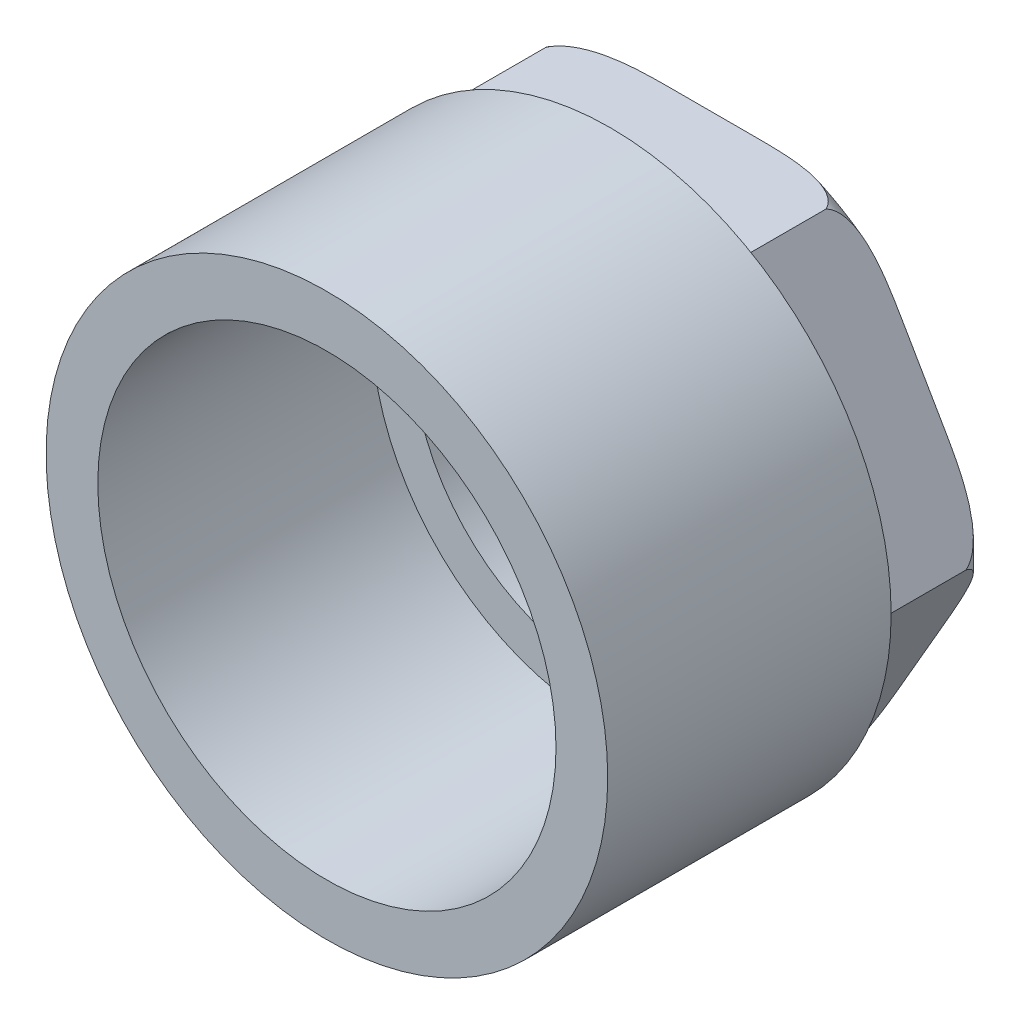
ISO-10303-21;
HEADER;
FILE_DESCRIPTION(('STEP AP214'),'2;1');
FILE_NAME('part.step','',(''),(''),'','','');
FILE_SCHEMA(('AUTOMOTIVE_DESIGN { 1 0 10303 214 1 1 1 1 }'));
ENDSEC;
DATA;
#1=APPLICATION_CONTEXT('core data for automotive mechanical design processes');
#2=APPLICATION_PROTOCOL_DEFINITION('international standard','automotive_design',2000,#1);
#3=PRODUCT_CONTEXT('',#1,'mechanical');
#4=PRODUCT('Part','Part','',(#3));
#5=PRODUCT_RELATED_PRODUCT_CATEGORY('part','',(#4));
#6=PRODUCT_DEFINITION_FORMATION('','',#4);
#7=PRODUCT_DEFINITION_CONTEXT('part definition',#1,'design');
#8=PRODUCT_DEFINITION('design','',#6,#7);
#9=PRODUCT_DEFINITION_SHAPE('','',#8);
#10=(LENGTH_UNIT() NAMED_UNIT(*) SI_UNIT(.MILLI.,.METRE.));
#11=(NAMED_UNIT(*) PLANE_ANGLE_UNIT() SI_UNIT($,.RADIAN.));
#12=(NAMED_UNIT(*) SI_UNIT($,.STERADIAN.) SOLID_ANGLE_UNIT());
#13=UNCERTAINTY_MEASURE_WITH_UNIT(LENGTH_MEASURE(1.E-05),#10,'distance_accuracy_value','');
#14=(GEOMETRIC_REPRESENTATION_CONTEXT(3) GLOBAL_UNCERTAINTY_ASSIGNED_CONTEXT((#13)) GLOBAL_UNIT_ASSIGNED_CONTEXT((#10,
#11,#12)) REPRESENTATION_CONTEXT('',''));
#15=CARTESIAN_POINT('',(0.,0.,0.));
#16=DIRECTION('',(0.,0.,1.));
#17=DIRECTION('',(1.,0.,0.));
#18=AXIS2_PLACEMENT_3D('',#15,#16,#17);
#19=CARTESIAN_POINT('',(0.,0.,0.));
#20=DIRECTION('',(0.,0.,1.));
#21=DIRECTION('',(1.,0.,0.));
#22=AXIS2_PLACEMENT_3D('',#19,#20,#21);
#23=CYLINDRICAL_SURFACE('',#22,19.9009);
#24=CARTESIAN_POINT('',(0.,0.,-35.814));
#25=DIRECTION('',(0.,0.,1.));
#26=DIRECTION('',(1.,0.,0.));
#27=AXIS2_PLACEMENT_3D('',#24,#25,#26);
#28=CIRCLE('',#27,19.9009);
#29=CARTESIAN_POINT('',(19.9009,0.,-35.814));
#30=VERTEX_POINT('',#29);
#31=EDGE_CURVE('E173',#30,#30,#28,.T.);
#32=ORIENTED_EDGE('',*,*,#31,.F.);
#33=EDGE_LOOP('',(#32));
#34=FACE_BOUND('',#33,.T.);
#35=CARTESIAN_POINT('',(0.,0.,-33.47085));
#36=DIRECTION('',(0.,0.,1.));
#37=DIRECTION('',(0.,-1.,0.));
#38=AXIS2_PLACEMENT_3D('',#35,#36,#37);
#39=CIRCLE('',#38,19.9009);
#40=CARTESIAN_POINT('',(0.,-19.9009,-33.47085));
#41=VERTEX_POINT('',#40);
#42=EDGE_CURVE('E9',#41,#41,#39,.F.);
#43=ORIENTED_EDGE('',*,*,#42,.F.);
#44=EDGE_LOOP('',(#43));
#45=FACE_BOUND('',#44,.T.);
#46=ADVANCED_FACE('F14',(#34,#45),#23,.F.);
#47=CARTESIAN_POINT('',(0.,0.,-27.94));
#48=DIRECTION('',(0.,0.,1.));
#49=DIRECTION('',(1.,0.,0.));
#50=AXIS2_PLACEMENT_3D('',#47,#48,#49);
#51=CIRCLE('',#50,19.9009);
#52=CARTESIAN_POINT('',(19.9009,0.,-27.94));
#53=VERTEX_POINT('',#52);
#54=EDGE_CURVE('E133',#53,#53,#51,.T.);
#55=ORIENTED_EDGE('',*,*,#54,.T.);
#56=EDGE_LOOP('',(#55));
#57=FACE_BOUND('',#56,.T.);
#58=CARTESIAN_POINT('',(0.,0.,-28.194));
#59=DIRECTION('',(0.,0.,-1.));
#60=DIRECTION('',(0.,1.,0.));
#61=AXIS2_PLACEMENT_3D('',#58,#59,#60);
#62=CIRCLE('',#61,19.9009);
#63=CARTESIAN_POINT('',(0.,19.9009,-28.194));
#64=VERTEX_POINT('',#63);
#65=EDGE_CURVE('E23',#64,#64,#62,.F.);
#66=ORIENTED_EDGE('',*,*,#65,.F.);
#67=EDGE_LOOP('',(#66));
#68=FACE_BOUND('',#67,.T.);
#69=ADVANCED_FACE('F283',(#57,#68),#23,.F.);
#70=CARTESIAN_POINT('',(0.,19.9009,-35.814));
#71=DIRECTION('',(0.,0.,1.));
#72=DIRECTION('',(1.,0.,0.));
#73=AXIS2_PLACEMENT_3D('',#70,#71,#72);
#74=PLANE('',#73);
#75=ORIENTED_EDGE('',*,*,#31,.T.);
#76=EDGE_LOOP('',(#75));
#77=FACE_BOUND('',#76,.T.);
#78=DIRECTION('',(0.5,-0.866025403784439,0.));
#79=VECTOR('',#78,1.);
#80=CARTESIAN_POINT('',(12.9903810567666,22.5,-35.814));
#81=LINE('',#80,#79);
#82=CARTESIAN_POINT('',(17.4294584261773,14.8112924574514,-35.814));
#83=VERTEX_POINT('',#82);
#84=CARTESIAN_POINT('',(21.5416847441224,7.68870754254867,-35.814));
#85=VERTEX_POINT('',#84);
#86=EDGE_CURVE('E143',#83,#85,#81,.T.);
#87=ORIENTED_EDGE('',*,*,#86,.T.);
#88=CARTESIAN_POINT('',(0.,0.,-35.814));
#89=DIRECTION('',(0.,0.,1.));
#90=DIRECTION('',(1.,0.,0.));
#91=AXIS2_PLACEMENT_3D('',#88,#89,#90);
#92=CIRCLE('',#91,22.8727);
#93=CARTESIAN_POINT('',(21.5416847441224,-7.68870754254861,-35.814));
#94=VERTEX_POINT('',#93);
#95=EDGE_CURVE('E188',#85,#94,#92,.F.);
#96=ORIENTED_EDGE('',*,*,#95,.T.);
#97=DIRECTION('',(-0.5,-0.866025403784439,0.));
#98=VECTOR('',#97,1.);
#99=CARTESIAN_POINT('',(25.9807621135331,0.,-35.814));
#100=LINE('',#99,#98);
#101=CARTESIAN_POINT('',(17.4294584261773,-14.8112924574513,-35.814));
#102=VERTEX_POINT('',#101);
#103=EDGE_CURVE('E145',#94,#102,#100,.T.);
#104=ORIENTED_EDGE('',*,*,#103,.T.);
#105=CARTESIAN_POINT('',(4.1122263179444,-22.5,-35.814));
#106=VERTEX_POINT('',#105);
#107=EDGE_CURVE('E192',#102,#106,#92,.F.);
#108=ORIENTED_EDGE('',*,*,#107,.T.);
#109=DIRECTION('',(-1.,0.,0.));
#110=VECTOR('',#109,1.);
#111=CARTESIAN_POINT('',(12.9903810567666,-22.5,-35.814));
#112=LINE('',#111,#110);
#113=CARTESIAN_POINT('',(-4.1122263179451,-22.5,-35.814));
#114=VERTEX_POINT('',#113);
#115=EDGE_CURVE('E148',#106,#114,#112,.T.);
#116=ORIENTED_EDGE('',*,*,#115,.T.);
#117=CARTESIAN_POINT('',(-17.4294584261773,-14.8112924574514,-35.814));
#118=VERTEX_POINT('',#117);
#119=EDGE_CURVE('E378',#114,#118,#92,.F.);
#120=ORIENTED_EDGE('',*,*,#119,.T.);
#121=DIRECTION('',(-0.5,0.866025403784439,0.));
#122=VECTOR('',#121,1.);
#123=CARTESIAN_POINT('',(-12.9903810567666,-22.5,-35.814));
#124=LINE('',#123,#122);
#125=CARTESIAN_POINT('',(-21.5416847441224,-7.68870754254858,-35.814));
#126=VERTEX_POINT('',#125);
#127=EDGE_CURVE('E151',#118,#126,#124,.T.);
#128=ORIENTED_EDGE('',*,*,#127,.T.);
#129=CARTESIAN_POINT('',(-21.5416847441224,7.68870754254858,-35.814));
#130=VERTEX_POINT('',#129);
#131=EDGE_CURVE('E380',#126,#130,#92,.F.);
#132=ORIENTED_EDGE('',*,*,#131,.T.);
#133=DIRECTION('',(0.5,0.866025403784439,0.));
#134=VECTOR('',#133,1.);
#135=CARTESIAN_POINT('',(-25.9807621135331,0.,-35.814));
#136=LINE('',#135,#134);
#137=CARTESIAN_POINT('',(-17.4294584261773,14.8112924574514,-35.814));
#138=VERTEX_POINT('',#137);
#139=EDGE_CURVE('E130',#130,#138,#136,.T.);
#140=ORIENTED_EDGE('',*,*,#139,.T.);
#141=CARTESIAN_POINT('',(-4.11222631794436,22.5,-35.814));
#142=VERTEX_POINT('',#141);
#143=EDGE_CURVE('E382',#138,#142,#92,.F.);
#144=ORIENTED_EDGE('',*,*,#143,.T.);
#145=DIRECTION('',(1.,0.,0.));
#146=VECTOR('',#145,1.);
#147=CARTESIAN_POINT('',(-12.9903810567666,22.5,-35.814));
#148=LINE('',#147,#146);
#149=CARTESIAN_POINT('',(4.11222631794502,22.5,-35.814));
#150=VERTEX_POINT('',#149);
#151=EDGE_CURVE('E127',#142,#150,#148,.T.);
#152=ORIENTED_EDGE('',*,*,#151,.T.);
#153=EDGE_CURVE('E191',#150,#83,#92,.F.);
#154=ORIENTED_EDGE('',*,*,#153,.T.);
#155=EDGE_LOOP('',(#87,#96,#104,#108,#116,#120,#128,#132,#140,#144,#152,#154));
#156=FACE_BOUND('',#155,.T.);
#157=ADVANCED_FACE('F319',(#77,#156),#74,.F.);
#158=CARTESIAN_POINT('',(0.,0.,0.));
#159=DIRECTION('',(0.,0.,1.));
#160=DIRECTION('',(1.,0.,0.));
#161=AXIS2_PLACEMENT_3D('',#158,#159,#160);
#162=CYLINDRICAL_SURFACE('',#161,26.0477);
#163=CARTESIAN_POINT('',(0.,0.,0.));
#164=DIRECTION('',(0.,0.,1.));
#165=DIRECTION('',(1.,0.,0.));
#166=AXIS2_PLACEMENT_3D('',#163,#164,#165);
#167=CIRCLE('',#166,26.0477);
#168=CARTESIAN_POINT('',(26.0477,0.,0.));
#169=VERTEX_POINT('',#168);
#170=EDGE_CURVE('E170',#169,#169,#167,.T.);
#171=ORIENTED_EDGE('',*,*,#170,.F.);
#172=EDGE_LOOP('',(#171));
#173=FACE_BOUND('',#172,.T.);
#174=CARTESIAN_POINT('',(0.,0.,-26.289));
#175=DIRECTION('',(0.,0.,-1.));
#176=DIRECTION('',(-1.,0.,0.));
#177=AXIS2_PLACEMENT_3D('',#174,#175,#176);
#178=CIRCLE('',#177,26.0477);
#179=CARTESIAN_POINT('',(-26.0477,0.,-26.289));
#180=VERTEX_POINT('',#179);
#181=EDGE_CURVE('E157',#180,#180,#178,.T.);
#182=ORIENTED_EDGE('',*,*,#181,.F.);
#183=EDGE_LOOP('',(#182));
#184=FACE_BOUND('',#183,.T.);
#185=ADVANCED_FACE('F316',(#173,#184),#162,.T.);
#186=CARTESIAN_POINT('',(0.,0.,-32.639));
#187=DIRECTION('',(0.,0.,1.));
#188=DIRECTION('',(1.,0.,0.));
#189=AXIS2_PLACEMENT_3D('',#186,#187,#188);
#190=TOROIDAL_SURFACE('',#189,22.8727,3.175);
#191=CARTESIAN_POINT('',(0.,22.5,-35.7920492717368));
#192=CARTESIAN_POINT('',(0.264577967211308,22.5,-35.7920440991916));
#193=CARTESIAN_POINT('',(0.529155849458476,22.5,-35.7926102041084));
#194=CARTESIAN_POINT('',(1.05830760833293,22.5,-35.7947340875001));
#195=CARTESIAN_POINT('',(1.32288148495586,22.5,-35.7962918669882));
#196=CARTESIAN_POINT('',(1.8520673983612,22.5,-35.8000253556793));
#197=CARTESIAN_POINT('',(2.11667943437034,22.5,-35.8022011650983));
#198=CARTESIAN_POINT('',(2.64590299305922,22.5,-35.8065481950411));
#199=CARTESIAN_POINT('',(2.9105145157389,22.5,-35.8087194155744));
#200=CARTESIAN_POINT('',(3.43977236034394,22.5,-35.8122117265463));
#201=CARTESIAN_POINT('',(3.70441868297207,22.5,-35.81353272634));
#202=CARTESIAN_POINT('',(4.23372195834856,22.5,-35.8142656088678));
#203=CARTESIAN_POINT('',(4.49837891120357,22.5,-35.8136774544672));
#204=CARTESIAN_POINT('',(5.0276079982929,22.5,-35.8093273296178));
#205=CARTESIAN_POINT('',(5.29218013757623,22.5,-35.8055661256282));
#206=CARTESIAN_POINT('',(5.82121285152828,22.5,-35.7933943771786));
#207=CARTESIAN_POINT('',(6.0856734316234,22.5,-35.7849840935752));
#208=CARTESIAN_POINT('',(6.59055991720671,22.5,-35.762837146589));
#209=CARTESIAN_POINT('',(6.83100883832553,22.5,-35.7496473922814));
#210=CARTESIAN_POINT('',(7.31148033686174,22.5,-35.716484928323));
#211=CARTESIAN_POINT('',(7.55150286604,22.5,-35.696511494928));
#212=CARTESIAN_POINT('',(8.03124066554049,22.5,-35.6479679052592));
#213=CARTESIAN_POINT('',(8.27095404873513,22.5,-35.6193786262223));
#214=CARTESIAN_POINT('',(8.74885791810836,22.5,-35.5515117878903));
#215=CARTESIAN_POINT('',(8.98704869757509,22.5,-35.5122363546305));
#216=CARTESIAN_POINT('',(9.4252341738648,22.5,-35.4273093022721));
#217=CARTESIAN_POINT('',(9.62558283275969,22.5,-35.3835066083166));
#218=CARTESIAN_POINT('',(10.0235420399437,22.5,-35.2843125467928));
#219=CARTESIAN_POINT('',(10.2211512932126,22.5,-35.2289158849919));
#220=CARTESIAN_POINT('',(10.6110297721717,22.5,-35.1043930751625));
#221=CARTESIAN_POINT('',(10.80331985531,22.5,-35.0353331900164));
#222=CARTESIAN_POINT('',(11.180871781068,22.5,-34.8803297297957));
#223=CARTESIAN_POINT('',(11.3661424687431,22.5,-34.7944083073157));
#224=CARTESIAN_POINT('',(11.6747786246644,22.5,-34.6290117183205));
#225=CARTESIAN_POINT('',(11.800831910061,22.5,-34.5545869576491));
#226=CARTESIAN_POINT('',(12.0449694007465,22.5,-34.3931705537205));
#227=CARTESIAN_POINT('',(12.163044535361,22.5,-34.3061649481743));
#228=CARTESIAN_POINT('',(12.3884509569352,22.5,-34.1168985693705));
#229=CARTESIAN_POINT('',(12.4956665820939,22.5,-34.0144976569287));
#230=CARTESIAN_POINT('',(12.6920767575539,22.5,-33.7935880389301));
#231=CARTESIAN_POINT('',(12.7813149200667,22.5,-33.6751195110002));
#232=CARTESIAN_POINT('',(12.9090649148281,22.5,-33.4631848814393));
#233=CARTESIAN_POINT('',(12.9546509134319,22.5,-33.3740050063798));
#234=CARTESIAN_POINT('',(13.0309208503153,22.5,-33.1894499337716));
#235=CARTESIAN_POINT('',(13.0616189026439,22.5,-33.0940807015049));
#236=CARTESIAN_POINT('',(13.1056975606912,22.5,-32.8986153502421));
#237=CARTESIAN_POINT('',(13.1189521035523,22.5,-32.7984901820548));
#238=CARTESIAN_POINT('',(13.1263601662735,22.5,-32.5975324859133));
#239=CARTESIAN_POINT('',(13.1205180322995,22.5,-32.4967001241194));
#240=CARTESIAN_POINT('',(13.0918277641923,22.5,-32.3074491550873));
#241=CARTESIAN_POINT('',(13.0706614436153,22.5,-32.2187663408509));
#242=CARTESIAN_POINT('',(13.0149009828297,22.5,-32.0457696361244));
#243=CARTESIAN_POINT('',(12.9803012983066,22.5,-31.9614575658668));
#244=CARTESIAN_POINT('',(12.8833990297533,22.5,-31.7652477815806));
#245=CARTESIAN_POINT('',(12.8155528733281,22.5,-31.6560980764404));
#246=CARTESIAN_POINT('',(12.6633351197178,22.5,-31.4499793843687));
#247=CARTESIAN_POINT('',(12.5789245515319,22.5,-31.353040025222));
#248=CARTESIAN_POINT('',(12.4174478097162,22.5,-31.1902289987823));
#249=CARTESIAN_POINT('',(12.3425922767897,22.5,-31.1221186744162));
#250=CARTESIAN_POINT('',(12.1872081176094,22.5,-30.9926684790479));
#251=CARTESIAN_POINT('',(12.1066760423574,22.5,-30.9313327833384));
#252=CARTESIAN_POINT('',(11.858394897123,22.5,-30.7564588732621));
#253=CARTESIAN_POINT('',(11.6841058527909,22.5,-30.6521920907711));
#254=CARTESIAN_POINT('',(11.3327403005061,22.5,-30.46787031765));
#255=CARTESIAN_POINT('',(11.1560806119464,22.5,-30.3869892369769));
#256=CARTESIAN_POINT('',(10.7964412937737,22.5,-30.2403922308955));
#257=CARTESIAN_POINT('',(10.613455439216,22.5,-30.1746917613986));
#258=CARTESIAN_POINT('',(10.2431415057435,22.5,-30.0558163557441));
#259=CARTESIAN_POINT('',(10.0558058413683,22.5,-30.0026654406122));
#260=CARTESIAN_POINT('',(9.77289943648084,22.5,-29.9308882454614));
#261=CARTESIAN_POINT('',(9.67830822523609,22.5,-29.9082928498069));
#262=CARTESIAN_POINT('',(9.48858046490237,22.5,-29.865521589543));
#263=CARTESIAN_POINT('',(9.39344392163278,22.5,-29.8453456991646));
#264=CARTESIAN_POINT('',(9.11281179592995,22.5,-29.7892214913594));
#265=CARTESIAN_POINT('',(8.92670008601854,22.5,-29.756339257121));
#266=CARTESIAN_POINT('',(8.55335718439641,22.5,-29.6976071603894));
#267=CARTESIAN_POINT('',(8.36612578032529,22.5,-29.6717586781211));
#268=CARTESIAN_POINT('',(7.99082172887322,22.5,-29.6259808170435));
#269=CARTESIAN_POINT('',(7.80274860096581,22.5,-29.6060554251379));
#270=CARTESIAN_POINT('',(7.42613483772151,22.5,-29.5711968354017));
#271=CARTESIAN_POINT('',(7.23759416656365,22.5,-29.5562640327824));
#272=CARTESIAN_POINT('',(6.67035363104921,22.5,-29.517597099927));
#273=CARTESIAN_POINT('',(6.29123017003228,22.5,-29.5001288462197));
#274=CARTESIAN_POINT('',(5.53283211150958,22.5,-29.4762192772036));
#275=CARTESIAN_POINT('',(5.15355760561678,22.5,-29.4697743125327));
#276=CARTESIAN_POINT('',(4.39217181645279,22.5,-29.463384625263));
#277=CARTESIAN_POINT('',(4.01006025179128,22.5,-29.4634882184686));
#278=CARTESIAN_POINT('',(3.24583356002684,22.5,-29.4666344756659));
#279=CARTESIAN_POINT('',(2.86371843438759,22.5,-29.4696773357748));
#280=CARTESIAN_POINT('',(2.10031308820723,22.5,-29.4759212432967));
#281=CARTESIAN_POINT('',(1.71902286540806,22.5,-29.4791219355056));
#282=CARTESIAN_POINT('',(0.956443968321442,22.5,-29.4838935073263));
#283=CARTESIAN_POINT('',(0.575155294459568,22.5,-29.4854644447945));
#284=CARTESIAN_POINT('',(-0.182721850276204,22.5,-29.4862350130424));
#285=CARTESIAN_POINT('',(-0.559310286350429,22.5,-29.4854636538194));
#286=CARTESIAN_POINT('',(-1.31248706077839,22.5,-29.4819598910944));
#287=CARTESIAN_POINT('',(-1.68907539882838,22.5,-29.4792274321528));
#288=CARTESIAN_POINT('',(-2.44291856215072,22.5,-29.4731690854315));
#289=CARTESIAN_POINT('',(-2.8201733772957,22.5,-29.4698421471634));
#290=CARTESIAN_POINT('',(-3.57468080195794,22.5,-29.4649346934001));
#291=CARTESIAN_POINT('',(-3.95193341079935,22.5,-29.4633540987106));
#292=CARTESIAN_POINT('',(-4.70325499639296,22.5,-29.4651422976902));
#293=CARTESIAN_POINT('',(-5.07732392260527,22.5,-29.46846935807));
#294=CARTESIAN_POINT('',(-5.82539279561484,22.5,-29.4839659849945));
#295=CARTESIAN_POINT('',(-6.19939270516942,22.5,-29.4961376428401));
#296=CARTESIAN_POINT('',(-6.94589602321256,22.5,-29.5341725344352));
#297=CARTESIAN_POINT('',(-7.31840087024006,22.5,-29.5600028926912));
#298=CARTESIAN_POINT('',(-7.8756442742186,22.5,-29.6136185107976));
#299=CARTESIAN_POINT('',(-8.06109665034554,22.5,-29.6339622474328));
#300=CARTESIAN_POINT('',(-8.4312502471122,22.5,-29.6805561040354));
#301=CARTESIAN_POINT('',(-8.6159515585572,22.5,-29.7068054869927));
#302=CARTESIAN_POINT('',(-8.94440619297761,22.5,-29.7598574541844));
#303=CARTESIAN_POINT('',(-9.08837643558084,22.5,-29.7853126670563));
#304=CARTESIAN_POINT('',(-9.37540805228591,22.5,-29.841128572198));
#305=CARTESIAN_POINT('',(-9.51846919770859,22.5,-29.8714904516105));
#306=CARTESIAN_POINT('',(-9.80375002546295,22.5,-29.9379145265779));
#307=CARTESIAN_POINT('',(-9.94596561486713,22.5,-29.9739944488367));
#308=CARTESIAN_POINT('',(-10.2286033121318,22.5,-30.0525990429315));
#309=CARTESIAN_POINT('',(-10.3690256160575,22.5,-30.0951230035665));
#310=CARTESIAN_POINT('',(-10.648851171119,22.5,-30.1880525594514));
#311=CARTESIAN_POINT('',(-10.7882294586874,22.5,-30.2385340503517));
#312=CARTESIAN_POINT('',(-11.0635932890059,22.5,-30.3482621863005));
#313=CARTESIAN_POINT('',(-11.1995774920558,22.5,-30.4075122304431));
#314=CARTESIAN_POINT('',(-11.4661547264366,22.5,-30.535907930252));
#315=CARTESIAN_POINT('',(-11.5967676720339,22.5,-30.605011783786));
#316=CARTESIAN_POINT('',(-11.851047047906,22.5,-30.7548740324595));
#317=CARTESIAN_POINT('',(-11.9747211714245,22.5,-30.8356191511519));
#318=CARTESIAN_POINT('',(-12.1956031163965,22.5,-30.9984309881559));
#319=CARTESIAN_POINT('',(-12.2940948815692,22.5,-31.0787379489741));
#320=CARTESIAN_POINT('',(-12.4809860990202,22.5,-31.2506544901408));
#321=CARTESIAN_POINT('',(-12.569377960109,22.5,-31.3422724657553));
#322=CARTESIAN_POINT('',(-12.7328813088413,22.5,-31.5387397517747));
#323=CARTESIAN_POINT('',(-12.8078243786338,22.5,-31.6437320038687));
#324=CARTESIAN_POINT('',(-12.9373314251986,22.5,-31.8656291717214));
#325=CARTESIAN_POINT('',(-12.9919490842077,22.5,-31.9825016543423));
#326=CARTESIAN_POINT('',(-13.0632461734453,22.5,-32.1914596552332));
#327=CARTESIAN_POINT('',(-13.0862547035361,22.5,-32.2813857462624));
#328=CARTESIAN_POINT('',(-13.116767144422,22.5,-32.4638349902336));
#329=CARTESIAN_POINT('',(-13.1242819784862,22.5,-32.5563562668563));
#330=CARTESIAN_POINT('',(-13.123146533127,22.5,-32.7413866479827));
#331=CARTESIAN_POINT('',(-13.1144804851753,22.5,-32.8338956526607));
#332=CARTESIAN_POINT('',(-13.0817289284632,22.5,-33.0161357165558));
#333=CARTESIAN_POINT('',(-13.0576335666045,22.5,-33.1058649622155));
#334=CARTESIAN_POINT('',(-12.9888250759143,22.5,-33.3003473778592));
#335=CARTESIAN_POINT('',(-12.9406686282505,22.5,-33.4038748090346));
#336=CARTESIAN_POINT('',(-12.8281660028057,22.5,-33.6016870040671));
#337=CARTESIAN_POINT('',(-12.7637918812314,22.5,-33.6959554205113));
#338=CARTESIAN_POINT('',(-12.5894425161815,22.5,-33.9172231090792));
#339=CARTESIAN_POINT('',(-12.4723189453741,22.5,-34.0385449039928));
#340=CARTESIAN_POINT('',(-12.2210773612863,22.5,-34.2619202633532));
#341=CARTESIAN_POINT('',(-12.0869222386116,22.5,-34.3639305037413));
#342=CARTESIAN_POINT('',(-11.8227837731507,22.5,-34.5411830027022));
#343=CARTESIAN_POINT('',(-11.6939207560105,22.5,-34.6181275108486));
#344=CARTESIAN_POINT('',(-11.4300276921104,22.5,-34.7607276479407));
#345=CARTESIAN_POINT('',(-11.2949925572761,22.5,-34.8263737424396));
#346=CARTESIAN_POINT('',(-11.0203973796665,22.5,-34.9480328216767));
#347=CARTESIAN_POINT('',(-10.8808293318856,22.5,-35.0040275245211));
#348=CARTESIAN_POINT('',(-10.5986896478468,22.5,-35.1075696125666));
#349=CARTESIAN_POINT('',(-10.4561191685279,22.5,-35.1551201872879));
#350=CARTESIAN_POINT('',(-10.098435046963,22.5,-35.2644529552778));
#351=CARTESIAN_POINT('',(-9.8819718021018,22.5,-35.3218084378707));
#352=CARTESIAN_POINT('',(-9.44595690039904,22.5,-35.423456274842));
#353=CARTESIAN_POINT('',(-9.22640360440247,22.5,-35.4677413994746));
#354=CARTESIAN_POINT('',(-8.7849779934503,22.5,-35.5456903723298));
#355=CARTESIAN_POINT('',(-8.5631017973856,22.5,-35.5793318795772));
#356=CARTESIAN_POINT('',(-8.11826672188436,22.5,-35.6378266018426));
#357=CARTESIAN_POINT('',(-7.89530807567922,22.5,-35.6626816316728));
#358=CARTESIAN_POINT('',(-7.44773341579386,22.5,-35.705343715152));
#359=CARTESIAN_POINT('',(-7.22311444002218,22.5,-35.7231189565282));
#360=CARTESIAN_POINT('',(-6.7734853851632,22.5,-35.7528748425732));
#361=CARTESIAN_POINT('',(-6.54847527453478,22.5,-35.7648549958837));
#362=CARTESIAN_POINT('',(-6.09820248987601,22.5,-35.7842410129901));
#363=CARTESIAN_POINT('',(-5.87293976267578,22.5,-35.7916455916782));
#364=CARTESIAN_POINT('',(-5.42232511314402,22.5,-35.80294376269));
#365=CARTESIAN_POINT('',(-5.1969731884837,22.5,-35.8068372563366));
#366=CARTESIAN_POINT('',(-4.76411563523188,22.5,-35.8118450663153));
#367=CARTESIAN_POINT('',(-4.55661200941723,22.5,-35.8131552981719));
#368=CARTESIAN_POINT('',(-4.14163604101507,22.5,-35.8142410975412));
#369=CARTESIAN_POINT('',(-3.93416369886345,22.5,-35.8140169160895));
#370=CARTESIAN_POINT('',(-3.51916994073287,22.5,-35.8126041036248));
#371=CARTESIAN_POINT('',(-3.31164852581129,22.5,-35.8114152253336));
#372=CARTESIAN_POINT('',(-2.89660037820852,22.5,-35.8085584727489));
#373=CARTESIAN_POINT('',(-2.68907364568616,22.5,-35.806890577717));
#374=CARTESIAN_POINT('',(-2.06794027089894,22.5,-35.8018212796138));
#375=CARTESIAN_POINT('',(-1.65433408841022,22.5,-35.7983431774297));
#376=CARTESIAN_POINT('',(-0.827151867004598,22.5,-35.7934613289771));
#377=CARTESIAN_POINT('',(-0.413575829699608,22.5,-35.792057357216));
#378=CARTESIAN_POINT('',(0.,22.5,-35.7920492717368));
#379=B_SPLINE_CURVE_WITH_KNOTS('',3,(#191,#192,#193,#194,#195,#196,#197,#198,#199,#200,#201,
#202,#203,#204,#205,#206,#207,#208,#209,#210,#211,#212,#213,#214,#215,#216,#217,#218,#219,#220,
#221,#222,#223,#224,#225,#226,#227,#228,#229,#230,#231,#232,#233,#234,#235,#236,#237,#238,#239,
#240,#241,#242,#243,#244,#245,#246,#247,#248,#249,#250,#251,#252,#253,#254,#255,#256,#257,#258,
#259,#260,#261,#262,#263,#264,#265,#266,#267,#268,#269,#270,#271,#272,#273,#274,#275,#276,#277,
#278,#279,#280,#281,#282,#283,#284,#285,#286,#287,#288,#289,#290,#291,#292,#293,#294,#295,#296,
#297,#298,#299,#300,#301,#302,#303,#304,#305,#306,#307,#308,#309,#310,#311,#312,#313,#314,#315,
#316,#317,#318,#319,#320,#321,#322,#323,#324,#325,#326,#327,#328,#329,#330,#331,#332,#333,#334,
#335,#336,#337,#338,#339,#340,#341,#342,#343,#344,#345,#346,#347,#348,#349,#350,#351,#352,#353,
#354,#355,#356,#357,#358,#359,#360,#361,#362,#363,#364,#365,#366,#367,#368,#369,#370,#371,#372,
#373,#374,#375,#376,#377,#378),.UNSPECIFIED.,.T.,.F.,(4,2,2,2,2,2,2,2,2,2,2,2,2,2,2,2,2,2,2,2,2,
2,2,2,2,2,2,2,2,2,2,2,2,2,2,2,2,2,2,2,2,2,2,2,2,2,2,2,2,2,2,2,2,2,2,2,2,2,2,2,2,2,2,2,2,2,2,2,2,
2,2,2,2,2,2,2,2,2,2,2,2,2,2,2,2,2,2,2,2,2,2,2,2,4),(0.,0.793733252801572,1.58746731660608,
2.38133016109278,3.17519137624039,3.96913721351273,4.76309849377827,5.55686804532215,
6.35059306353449,7.07295111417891,7.79538625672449,8.51943679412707,9.24334338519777,
9.85831353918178,10.4735651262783,11.0859029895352,11.6974416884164,12.1360115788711,
12.5750719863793,13.0184026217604,13.4606444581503,13.7600223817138,14.0591159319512,
14.3603593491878,14.6615342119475,14.9338727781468,15.2063238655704,15.5897232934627,
15.9740357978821,16.2772275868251,16.5806052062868,17.1879546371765,17.7700649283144,
18.3527653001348,18.9365721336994,19.228304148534,19.5200330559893,20.0868373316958,
20.653752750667,21.2210489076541,21.7883899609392,22.9266757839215,24.0645846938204,
25.2108901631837,26.357272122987,27.5011824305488,28.6450521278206,29.7748127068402,
30.9046052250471,32.0364142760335,33.1681719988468,34.290360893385,35.4128152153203,
36.5325800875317,37.0922013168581,37.6517527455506,38.0902911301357,38.5289357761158,
38.9689678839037,39.408951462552,39.8534183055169,40.2980578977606,40.7408644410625,
41.1831699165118,41.5636982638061,41.944510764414,42.3298020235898,42.7140683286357,
42.9913383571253,43.2684128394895,43.5457574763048,43.8232794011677,44.1639336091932,
44.5051788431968,45.0082469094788,45.512430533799,45.9620386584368,46.412024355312,
46.862853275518,47.3135115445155,47.9847598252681,48.6563787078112,49.3293981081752,
50.0022784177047,50.6781490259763,51.3540769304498,52.0301945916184,52.7063312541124,
53.3288468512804,53.9512606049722,54.5738339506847,55.1964342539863,56.4372956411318,
57.6780221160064),.UNSPECIFIED.);
#380=CARTESIAN_POINT('',(12.9903810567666,22.5,-33.2875174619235));
#381=VERTEX_POINT('',#380);
#382=EDGE_CURVE('E264',#150,#381,#379,.T.);
#383=ORIENTED_EDGE('',*,*,#382,.T.);
#384=CARTESIAN_POINT('',(12.9902655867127,22.5002,-33.2869638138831));
#385=CARTESIAN_POINT('',(13.0158062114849,22.4559623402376,-33.4094044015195));
#386=CARTESIAN_POINT('',(13.0476572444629,22.4007947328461,-33.5255786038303));
#387=CARTESIAN_POINT('',(13.1205378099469,22.2745618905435,-33.7436799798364));
#388=CARTESIAN_POINT('',(13.1614377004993,22.2037212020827,-33.8457782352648));
#389=CARTESIAN_POINT('',(13.2379362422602,22.0712218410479,-34.0115682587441));
#390=CARTESIAN_POINT('',(13.272002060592,22.0122181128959,-34.0782041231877));
#391=CARTESIAN_POINT('',(13.3429252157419,21.889375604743,-34.2052743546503));
#392=CARTESIAN_POINT('',(13.3797834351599,21.8255352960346,-34.2657067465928));
#393=CARTESIAN_POINT('',(13.494108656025,21.6275182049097,-34.4391844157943));
#394=CARTESIAN_POINT('',(13.5748875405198,21.487605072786,-34.5435084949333));
#395=CARTESIAN_POINT('',(13.7360937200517,21.2083877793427,-34.7264544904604));
#396=CARTESIAN_POINT('',(13.816176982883,21.069679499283,-34.8063356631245));
#397=CARTESIAN_POINT('',(13.9794960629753,20.7868025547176,-34.9522554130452));
#398=CARTESIAN_POINT('',(14.0627347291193,20.6426289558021,-35.01828111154));
#399=CARTESIAN_POINT('',(14.2312611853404,20.3507325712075,-35.1386523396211));
#400=CARTESIAN_POINT('',(14.3165489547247,20.2030098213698,-35.1929979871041));
#401=CARTESIAN_POINT('',(14.4884746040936,19.9052258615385,-35.2918281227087));
#402=CARTESIAN_POINT('',(14.5751117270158,19.7551659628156,-35.3363179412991));
#403=CARTESIAN_POINT('',(14.7386626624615,19.4718874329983,-35.4120290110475));
#404=CARTESIAN_POINT('',(14.815467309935,19.3388578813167,-35.4442080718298));
#405=CARTESIAN_POINT('',(14.9696108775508,19.0718733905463,-35.5030020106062));
#406=CARTESIAN_POINT('',(15.0469498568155,18.9379183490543,-35.5296162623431));
#407=CARTESIAN_POINT('',(15.2796132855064,18.5349334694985,-35.6022598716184));
#408=CARTESIAN_POINT('',(15.4355035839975,18.2649235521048,-35.6410545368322));
#409=CARTESIAN_POINT('',(15.748390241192,17.7229879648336,-35.7042584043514));
#410=CARTESIAN_POINT('',(15.9053884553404,17.451059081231,-35.728628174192));
#411=CARTESIAN_POINT('',(16.2196522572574,16.906738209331,-35.7666339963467));
#412=CARTESIAN_POINT('',(16.3769177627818,16.6343463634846,-35.7802729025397));
#413=CARTESIAN_POINT('',(16.6925030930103,16.0877365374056,-35.8000265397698));
#414=CARTESIAN_POINT('',(16.850823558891,15.8135174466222,-35.8060954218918));
#415=CARTESIAN_POINT('',(17.1674956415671,15.2650253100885,-35.8132223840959));
#416=CARTESIAN_POINT('',(17.3258472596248,14.9907522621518,-35.8142801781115));
#417=CARTESIAN_POINT('',(17.6423216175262,14.4426025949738,-35.8136014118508));
#418=CARTESIAN_POINT('',(17.8004443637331,14.1687259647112,-35.8118688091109));
#419=CARTESIAN_POINT('',(18.1166817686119,13.6209867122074,-35.8074064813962));
#420=CARTESIAN_POINT('',(18.2747964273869,13.3471240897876,-35.804676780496));
#421=CARTESIAN_POINT('',(18.5464037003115,12.876686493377,-35.8002825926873));
#422=CARTESIAN_POINT('',(18.6598959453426,12.6801121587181,-35.7985348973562));
#423=CARTESIAN_POINT('',(18.8868821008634,12.2869606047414,-35.7955600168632));
#424=CARTESIAN_POINT('',(19.0003760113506,12.0903833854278,-35.7943328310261));
#425=CARTESIAN_POINT('',(19.2273972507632,11.6971710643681,-35.7926195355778));
#426=CARTESIAN_POINT('',(19.340924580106,11.5005359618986,-35.7921336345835));
#427=CARTESIAN_POINT('',(19.5679792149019,11.1072657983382,-35.7919852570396));
#428=CARTESIAN_POINT('',(19.6815065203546,10.9106307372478,-35.7923227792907));
#429=CARTESIAN_POINT('',(19.9081802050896,10.5180203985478,-35.7937621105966));
#430=CARTESIAN_POINT('',(20.0213265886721,10.3220451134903,-35.7948613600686));
#431=CARTESIAN_POINT('',(20.247617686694,9.93009743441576,-35.7976290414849));
#432=CARTESIAN_POINT('',(20.3607624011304,9.7341250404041,-35.7992974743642));
#433=CARTESIAN_POINT('',(20.587043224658,9.34219515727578,-35.8028802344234));
#434=CARTESIAN_POINT('',(20.7001793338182,9.14623766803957,-35.8047945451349));
#435=CARTESIAN_POINT('',(20.9264523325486,8.75432133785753,-35.8084199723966));
#436=CARTESIAN_POINT('',(21.0395892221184,8.55836249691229,-35.8101310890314));
#437=CARTESIAN_POINT('',(21.2963009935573,8.11372466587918,-35.8131456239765));
#438=CARTESIAN_POINT('',(21.4398767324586,7.8650441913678,-35.8142155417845));
#439=CARTESIAN_POINT('',(21.7270347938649,7.36767183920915,-35.8137120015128));
#440=CARTESIAN_POINT('',(21.8706171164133,7.11897996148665,-35.8121384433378));
#441=CARTESIAN_POINT('',(22.1581628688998,6.62093610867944,-35.8046326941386));
#442=CARTESIAN_POINT('',(22.3021262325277,6.37158424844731,-35.7986882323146));
#443=CARTESIAN_POINT('',(22.5899487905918,5.8730609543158,-35.7804001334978));
#444=CARTESIAN_POINT('',(22.7338079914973,5.62388950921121,-35.7680569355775));
#445=CARTESIAN_POINT('',(23.0262645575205,5.11733987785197,-35.7340023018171));
#446=CARTESIAN_POINT('',(23.1748534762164,4.85997632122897,-35.7119812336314));
#447=CARTESIAN_POINT('',(23.4715026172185,4.34616493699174,-35.6553397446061));
#448=CARTESIAN_POINT('',(23.6195626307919,4.08971747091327,-35.6207148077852));
#449=CARTESIAN_POINT('',(23.9138714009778,3.57995972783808,-35.5351203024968));
#450=CARTESIAN_POINT('',(24.0601253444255,3.32664046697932,-35.4842262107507));
#451=CARTESIAN_POINT('',(24.2777473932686,2.94970802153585,-35.3918374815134));
#452=CARTESIAN_POINT('',(24.3499717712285,2.82461172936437,-35.3583801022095));
#453=CARTESIAN_POINT('',(24.4936352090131,2.57577935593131,-35.2853185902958));
#454=CARTESIAN_POINT('',(24.5650744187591,2.45204301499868,-35.2457156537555));
#455=CARTESIAN_POINT('',(24.6897391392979,2.23611738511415,-35.169879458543));
#456=CARTESIAN_POINT('',(24.7431926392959,2.14353320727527,-35.1351461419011));
#457=CARTESIAN_POINT('',(24.8493161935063,1.95972181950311,-35.0611530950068));
#458=CARTESIAN_POINT('',(24.9019862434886,1.86849461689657,-35.0218933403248));
#459=CARTESIAN_POINT('',(25.0065563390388,1.68737389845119,-34.938131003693));
#460=CARTESIAN_POINT('',(25.0584518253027,1.59748827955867,-34.8936055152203));
#461=CARTESIAN_POINT('',(25.1609215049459,1.42000558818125,-34.7988496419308));
#462=CARTESIAN_POINT('',(25.2114959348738,1.33240810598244,-34.7486202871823));
#463=CARTESIAN_POINT('',(25.3117321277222,1.15879392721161,-34.6408950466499));
#464=CARTESIAN_POINT('',(25.3613663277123,1.07282497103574,-34.5832957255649));
#465=CARTESIAN_POINT('',(25.458320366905,0.904895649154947,-34.4606352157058));
#466=CARTESIAN_POINT('',(25.5056393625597,0.822936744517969,-34.3955713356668));
#467=CARTESIAN_POINT('',(25.5967280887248,0.665166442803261,-34.2577573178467));
#468=CARTESIAN_POINT('',(25.6405270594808,0.589304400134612,-34.1850853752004));
#469=CARTESIAN_POINT('',(25.7239570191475,0.444799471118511,-34.0308241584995));
#470=CARTESIAN_POINT('',(25.7635927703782,0.376148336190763,-33.9492452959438));
#471=CARTESIAN_POINT('',(25.8371450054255,0.248752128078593,-33.7768551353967));
#472=CARTESIAN_POINT('',(25.8710896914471,0.189958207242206,-33.6860931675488));
#473=CARTESIAN_POINT('',(25.9319645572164,0.08451984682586,-33.4941467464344));
#474=CARTESIAN_POINT('',(25.9588049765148,0.0380308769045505,-33.3928495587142));
#475=CARTESIAN_POINT('',(25.980877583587,-0.00019999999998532,-33.2869638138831));
#476=B_SPLINE_CURVE_WITH_KNOTS('',3,(#384,#385,#386,#387,#388,#389,#390,#391,#392,#393,#394,
#395,#396,#397,#398,#399,#400,#401,#402,#403,#404,#405,#406,#407,#408,#409,#410,#411,#412,#413,
#414,#415,#416,#417,#418,#419,#420,#421,#422,#423,#424,#425,#426,#427,#428,#429,#430,#431,#432,
#433,#434,#435,#436,#437,#438,#439,#440,#441,#442,#443,#444,#445,#446,#447,#448,#449,#450,#451,
#452,#453,#454,#455,#456,#457,#458,#459,#460,#461,#462,#463,#464,#465,#466,#467,#468,#469,#470,
#471,#472,#473,#474,#475),.UNSPECIFIED.,.F.,.F.,(4,2,2,2,2,2,2,2,2,2,2,2,2,2,2,2,2,2,2,2,2,2,2,
2,2,2,2,2,2,2,2,2,2,2,2,2,2,2,2,2,2,2,2,2,2,4),(0.,0.395967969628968,0.786593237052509,
1.072156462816,1.35781032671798,1.9328487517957,2.46908757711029,3.0058226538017,
3.54255231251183,4.07899097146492,4.54970786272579,5.02047769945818,5.96251186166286,
6.90710945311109,7.85145574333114,8.8014942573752,9.75158700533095,10.7003334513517,
11.6490569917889,12.3300303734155,13.0110028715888,13.6921669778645,14.3733300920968,
15.0522153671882,15.7311017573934,16.4099427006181,17.088783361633,17.9502380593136,
18.8117253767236,19.6756404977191,20.5394963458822,21.4332688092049,22.3273618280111,
23.217365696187,23.6620789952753,24.1067058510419,24.4438429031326,24.7809817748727,
25.1196452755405,25.4582477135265,25.8022695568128,26.1464158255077,26.4873195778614,
26.8278290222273,27.1665977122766,27.5094618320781),.UNSPECIFIED.);
#477=EDGE_CURVE('E230',#381,#83,#476,.T.);
#478=ORIENTED_EDGE('',*,*,#477,.T.);
#479=ORIENTED_EDGE('',*,*,#153,.F.);
#480=EDGE_LOOP('',(#383,#478,#479));
#481=FACE_BOUND('',#480,.T.);
#482=ADVANCED_FACE('F208',(#481),#190,.T.);
#483=CARTESIAN_POINT('',(-25.980877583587,-0.00019999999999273,-33.2869638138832));
#484=CARTESIAN_POINT('',(-25.9553369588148,0.0440376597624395,-33.4094044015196));
#485=CARTESIAN_POINT('',(-25.9234859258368,0.0992052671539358,-33.5255786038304));
#486=CARTESIAN_POINT('',(-25.8506053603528,0.225438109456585,-33.7436799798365));
#487=CARTESIAN_POINT('',(-25.8097054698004,0.296278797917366,-33.8457782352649));
#488=CARTESIAN_POINT('',(-25.7332069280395,0.428778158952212,-34.0115682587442));
#489=CARTESIAN_POINT('',(-25.6991411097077,0.48778188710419,-34.0782041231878));
#490=CARTESIAN_POINT('',(-25.6282179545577,0.610624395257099,-34.2052743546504));
#491=CARTESIAN_POINT('',(-25.5913597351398,0.674464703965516,-34.2657067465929));
#492=CARTESIAN_POINT('',(-25.4770345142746,0.872481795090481,-34.4391844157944));
#493=CARTESIAN_POINT('',(-25.3962556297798,1.01239492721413,-34.5435084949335));
#494=CARTESIAN_POINT('',(-25.2350494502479,1.29161222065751,-34.7264544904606));
#495=CARTESIAN_POINT('',(-25.1549661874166,1.43032050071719,-34.8063356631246));
#496=CARTESIAN_POINT('',(-24.9916471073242,1.71319744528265,-34.9522554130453));
#497=CARTESIAN_POINT('',(-24.9084084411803,1.8573710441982,-35.0182811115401));
#498=CARTESIAN_POINT('',(-24.7398819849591,2.14926742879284,-35.1386523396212));
#499=CARTESIAN_POINT('',(-24.6545942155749,2.29699017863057,-35.1929979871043));
#500=CARTESIAN_POINT('',(-24.4826685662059,2.59477413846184,-35.2918281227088));
#501=CARTESIAN_POINT('',(-24.3960314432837,2.74483403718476,-35.3363179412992));
#502=CARTESIAN_POINT('',(-24.232480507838,3.02811256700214,-35.4120290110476));
#503=CARTESIAN_POINT('',(-24.1556758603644,3.16114211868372,-35.4442080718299));
#504=CARTESIAN_POINT('',(-24.0015322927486,3.42812660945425,-35.5030020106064));
#505=CARTESIAN_POINT('',(-23.9241933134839,3.56208165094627,-35.5296162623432));
#506=CARTESIAN_POINT('',(-23.6915298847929,3.96506653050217,-35.6022598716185));
#507=CARTESIAN_POINT('',(-23.5356395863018,4.23507644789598,-35.6410545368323));
#508=CARTESIAN_POINT('',(-23.2227529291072,4.77701203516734,-35.7042584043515));
#509=CARTESIAN_POINT('',(-23.0657547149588,5.04894091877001,-35.7286281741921));
#510=CARTESIAN_POINT('',(-22.7514909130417,5.59326179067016,-35.7666339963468));
#511=CARTESIAN_POINT('',(-22.5942254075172,5.86565363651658,-35.7802729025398));
#512=CARTESIAN_POINT('',(-22.2786400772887,6.41226346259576,-35.8000265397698));
#513=CARTESIAN_POINT('',(-22.1203196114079,6.68648255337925,-35.8060954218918));
#514=CARTESIAN_POINT('',(-21.8036475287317,7.23497468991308,-35.813222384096));
#515=CARTESIAN_POINT('',(-21.6452959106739,7.50924773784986,-35.8142801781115));
#516=CARTESIAN_POINT('',(-21.3288215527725,8.05739740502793,-35.8136014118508));
#517=CARTESIAN_POINT('',(-21.1706988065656,8.33127403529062,-35.8118688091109));
#518=CARTESIAN_POINT('',(-20.8544614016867,8.8790132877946,-35.8074064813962));
#519=CARTESIAN_POINT('',(-20.6963467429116,9.15287591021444,-35.8046767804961));
#520=CARTESIAN_POINT('',(-20.424739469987,9.62331350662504,-35.8002825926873));
#521=CARTESIAN_POINT('',(-20.3112472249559,9.81988784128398,-35.7985348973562));
#522=CARTESIAN_POINT('',(-20.0842610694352,10.2130393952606,-35.7955600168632));
#523=CARTESIAN_POINT('',(-19.970767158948,10.4096166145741,-35.7943328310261));
#524=CARTESIAN_POINT('',(-19.7437459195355,10.8028289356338,-35.7926195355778));
#525=CARTESIAN_POINT('',(-19.6302185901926,10.9994640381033,-35.7921336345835));
#526=CARTESIAN_POINT('',(-19.4031639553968,11.3927342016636,-35.7919852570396));
#527=CARTESIAN_POINT('',(-19.2896366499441,11.589369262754,-35.7923227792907));
#528=CARTESIAN_POINT('',(-19.0629629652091,11.9819796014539,-35.7937621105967));
#529=CARTESIAN_POINT('',(-18.9498165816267,12.1779548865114,-35.7948613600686));
#530=CARTESIAN_POINT('',(-18.7235254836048,12.5699025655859,-35.7976290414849));
#531=CARTESIAN_POINT('',(-18.6103807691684,12.7658749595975,-35.7992974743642));
#532=CARTESIAN_POINT('',(-18.3840999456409,13.1578048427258,-35.8028802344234));
#533=CARTESIAN_POINT('',(-18.2709638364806,13.3537623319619,-35.8047945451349));
#534=CARTESIAN_POINT('',(-18.0446908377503,13.7456786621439,-35.8084199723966));
#535=CARTESIAN_POINT('',(-17.9315539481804,13.9416375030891,-35.8101310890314));
#536=CARTESIAN_POINT('',(-17.6748421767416,14.3862753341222,-35.8131456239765));
#537=CARTESIAN_POINT('',(-17.5312664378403,14.6349558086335,-35.8142155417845));
#538=CARTESIAN_POINT('',(-17.2441083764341,15.1323281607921,-35.8137120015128));
#539=CARTESIAN_POINT('',(-17.1005260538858,15.3810200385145,-35.8121384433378));
#540=CARTESIAN_POINT('',(-16.8129803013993,15.8790638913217,-35.8046326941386));
#541=CARTESIAN_POINT('',(-16.6690169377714,16.1284157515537,-35.7986882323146));
#542=CARTESIAN_POINT('',(-16.3811943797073,16.6269390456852,-35.7804001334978));
#543=CARTESIAN_POINT('',(-16.2373351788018,16.8761104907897,-35.7680569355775));
#544=CARTESIAN_POINT('',(-15.9448786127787,17.3826601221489,-35.734002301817));
#545=CARTESIAN_POINT('',(-15.7962896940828,17.6400236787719,-35.7119812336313));
#546=CARTESIAN_POINT('',(-15.4996405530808,18.153835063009,-35.655339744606));
#547=CARTESIAN_POINT('',(-15.3515805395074,18.4102825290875,-35.620714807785));
#548=CARTESIAN_POINT('',(-15.0572717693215,18.9200402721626,-35.5351203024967));
#549=CARTESIAN_POINT('',(-14.9110178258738,19.1733595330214,-35.4842262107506));
#550=CARTESIAN_POINT('',(-14.6933957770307,19.5502919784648,-35.3918374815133));
#551=CARTESIAN_POINT('',(-14.6211713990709,19.6753882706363,-35.3583801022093));
#552=CARTESIAN_POINT('',(-14.4775079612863,19.9242206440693,-35.2853185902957));
#553=CARTESIAN_POINT('',(-14.4060687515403,20.0479569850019,-35.2457156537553));
#554=CARTESIAN_POINT('',(-14.2814040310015,20.2638826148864,-35.1698794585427));
#555=CARTESIAN_POINT('',(-14.2279505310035,20.3564667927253,-35.1351461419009));
#556=CARTESIAN_POINT('',(-14.1218269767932,20.5402781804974,-35.0611530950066));
#557=CARTESIAN_POINT('',(-14.0691569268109,20.6315053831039,-35.0218933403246));
#558=CARTESIAN_POINT('',(-13.9645868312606,20.8126261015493,-34.9381310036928));
#559=CARTESIAN_POINT('',(-13.9126913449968,20.9025117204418,-34.89360551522));
#560=CARTESIAN_POINT('',(-13.8102216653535,21.0799944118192,-34.7988496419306));
#561=CARTESIAN_POINT('',(-13.7596472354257,21.167591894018,-34.748620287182));
#562=CARTESIAN_POINT('',(-13.6594110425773,21.3412060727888,-34.6408950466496));
#563=CARTESIAN_POINT('',(-13.6097768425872,21.4271750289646,-34.5832957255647));
#564=CARTESIAN_POINT('',(-13.5128228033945,21.5951043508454,-34.4606352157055));
#565=CARTESIAN_POINT('',(-13.4655038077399,21.6770632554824,-34.3955713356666));
#566=CARTESIAN_POINT('',(-13.3744150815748,21.834833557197,-34.2577573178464));
#567=CARTESIAN_POINT('',(-13.3306161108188,21.9106955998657,-34.1850853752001));
#568=CARTESIAN_POINT('',(-13.2471861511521,22.0552005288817,-34.0308241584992));
#569=CARTESIAN_POINT('',(-13.2075503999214,22.1238516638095,-33.9492452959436));
#570=CARTESIAN_POINT('',(-13.1339981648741,22.2512478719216,-33.7768551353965));
#571=CARTESIAN_POINT('',(-13.1000534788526,22.3100417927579,-33.6860931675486));
#572=CARTESIAN_POINT('',(-13.0391786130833,22.4154801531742,-33.4941467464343));
#573=CARTESIAN_POINT('',(-13.0123381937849,22.4619691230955,-33.3928495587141));
#574=CARTESIAN_POINT('',(-12.9902655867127,22.5002,-33.2869638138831));
#575=B_SPLINE_CURVE_WITH_KNOTS('',3,(#483,#484,#485,#486,#487,#488,#489,#490,#491,#492,#493,
#494,#495,#496,#497,#498,#499,#500,#501,#502,#503,#504,#505,#506,#507,#508,#509,#510,#511,#512,
#513,#514,#515,#516,#517,#518,#519,#520,#521,#522,#523,#524,#525,#526,#527,#528,#529,#530,#531,
#532,#533,#534,#535,#536,#537,#538,#539,#540,#541,#542,#543,#544,#545,#546,#547,#548,#549,#550,
#551,#552,#553,#554,#555,#556,#557,#558,#559,#560,#561,#562,#563,#564,#565,#566,#567,#568,#569,
#570,#571,#572,#573,#574),.UNSPECIFIED.,.F.,.F.,(4,2,2,2,2,2,2,2,2,2,2,2,2,2,2,2,2,2,2,2,2,2,2,
2,2,2,2,2,2,2,2,2,2,2,2,2,2,2,2,2,2,2,2,2,2,4),(0.,0.395967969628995,0.786593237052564,
1.07215646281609,1.35781032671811,1.93284875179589,2.46908757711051,3.00582265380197,
3.54255231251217,4.07899097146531,4.54970786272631,5.02047769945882,5.96251186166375,
6.90710945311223,7.85145574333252,8.80149425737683,9.75158700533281,10.7003334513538,
11.6490569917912,12.3300303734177,13.0110028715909,13.6921669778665,14.3733300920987,
15.05221536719,15.7311017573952,16.4099427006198,17.0887833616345,17.950238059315,
18.8117253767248,19.6756404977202,20.5394963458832,21.4332688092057,22.3273618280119,
23.2173656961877,23.662078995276,24.1067058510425,24.4438429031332,24.7809817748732,
25.119645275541,25.458247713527,25.8022695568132,26.1464158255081,26.4873195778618,
26.8278290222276,27.1665977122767,27.5094618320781),.UNSPECIFIED.);
#576=CARTESIAN_POINT('',(-12.9903810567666,22.5,-33.2875174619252));
#577=VERTEX_POINT('',#576);
#578=EDGE_CURVE('E265',#138,#577,#575,.T.);
#579=ORIENTED_EDGE('',*,*,#578,.T.);
#580=EDGE_CURVE('E258',#577,#142,#379,.T.);
#581=ORIENTED_EDGE('',*,*,#580,.T.);
#582=ORIENTED_EDGE('',*,*,#143,.F.);
#583=EDGE_LOOP('',(#579,#581,#582));
#584=FACE_BOUND('',#583,.T.);
#585=ADVANCED_FACE('F388',(#584),#190,.T.);
#586=CARTESIAN_POINT('',(-12.9902655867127,-22.5002,-33.2869638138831));
#587=CARTESIAN_POINT('',(-13.0158062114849,-22.4559623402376,-33.4094044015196));
#588=CARTESIAN_POINT('',(-13.0476572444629,-22.4007947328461,-33.5255786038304));
#589=CARTESIAN_POINT('',(-13.1205378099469,-22.2745618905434,-33.7436799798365));
#590=CARTESIAN_POINT('',(-13.1614377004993,-22.2037212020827,-33.8457782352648));
#591=CARTESIAN_POINT('',(-13.2379362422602,-22.0712218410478,-34.0115682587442));
#592=CARTESIAN_POINT('',(-13.272002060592,-22.0122181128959,-34.0782041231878));
#593=CARTESIAN_POINT('',(-13.342925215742,-21.889375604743,-34.2052743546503));
#594=CARTESIAN_POINT('',(-13.3797834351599,-21.8255352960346,-34.2657067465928));
#595=CARTESIAN_POINT('',(-13.494108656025,-21.6275182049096,-34.4391844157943));
#596=CARTESIAN_POINT('',(-13.5748875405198,-21.487605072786,-34.5435084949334));
#597=CARTESIAN_POINT('',(-13.7360937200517,-21.2083877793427,-34.7264544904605));
#598=CARTESIAN_POINT('',(-13.816176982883,-21.069679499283,-34.8063356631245));
#599=CARTESIAN_POINT('',(-13.9794960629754,-20.7868025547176,-34.9522554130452));
#600=CARTESIAN_POINT('',(-14.0627347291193,-20.642628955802,-35.01828111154));
#601=CARTESIAN_POINT('',(-14.2312611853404,-20.3507325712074,-35.1386523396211));
#602=CARTESIAN_POINT('',(-14.3165489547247,-20.2030098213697,-35.1929979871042));
#603=CARTESIAN_POINT('',(-14.4884746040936,-19.9052258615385,-35.2918281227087));
#604=CARTESIAN_POINT('',(-14.5751117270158,-19.7551659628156,-35.3363179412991));
#605=CARTESIAN_POINT('',(-14.7386626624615,-19.4718874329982,-35.4120290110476));
#606=CARTESIAN_POINT('',(-14.815467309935,-19.3388578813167,-35.4442080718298));
#607=CARTESIAN_POINT('',(-14.9696108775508,-19.0718733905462,-35.5030020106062));
#608=CARTESIAN_POINT('',(-15.0469498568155,-18.9379183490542,-35.5296162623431));
#609=CARTESIAN_POINT('',(-15.2796132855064,-18.5349334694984,-35.6022598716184));
#610=CARTESIAN_POINT('',(-15.4355035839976,-18.2649235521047,-35.6410545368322));
#611=CARTESIAN_POINT('',(-15.7483902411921,-17.7229879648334,-35.7042584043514));
#612=CARTESIAN_POINT('',(-15.9053884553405,-17.4510590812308,-35.728628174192));
#613=CARTESIAN_POINT('',(-16.2196522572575,-16.9067382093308,-35.7666339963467));
#614=CARTESIAN_POINT('',(-16.3769177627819,-16.6343463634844,-35.7802729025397));
#615=CARTESIAN_POINT('',(-16.6925030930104,-16.0877365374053,-35.8000265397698));
#616=CARTESIAN_POINT('',(-16.8508235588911,-15.8135174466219,-35.8060954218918));
#617=CARTESIAN_POINT('',(-17.1674956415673,-15.2650253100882,-35.8132223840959));
#618=CARTESIAN_POINT('',(-17.325847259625,-14.9907522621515,-35.8142801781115));
#619=CARTESIAN_POINT('',(-17.6423216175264,-14.4426025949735,-35.8136014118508));
#620=CARTESIAN_POINT('',(-17.8004443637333,-14.1687259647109,-35.8118688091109));
#621=CARTESIAN_POINT('',(-18.1166817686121,-13.620986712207,-35.8074064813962));
#622=CARTESIAN_POINT('',(-18.2747964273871,-13.3471240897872,-35.804676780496));
#623=CARTESIAN_POINT('',(-18.5464037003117,-12.8766864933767,-35.8002825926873));
#624=CARTESIAN_POINT('',(-18.6598959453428,-12.6801121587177,-35.7985348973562));
#625=CARTESIAN_POINT('',(-18.8868821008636,-12.2869606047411,-35.7955600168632));
#626=CARTESIAN_POINT('',(-19.0003760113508,-12.0903833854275,-35.7943328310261));
#627=CARTESIAN_POINT('',(-19.2273972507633,-11.6971710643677,-35.7926195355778));
#628=CARTESIAN_POINT('',(-19.3409245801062,-11.5005359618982,-35.7921336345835));
#629=CARTESIAN_POINT('',(-19.567979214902,-11.1072657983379,-35.7919852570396));
#630=CARTESIAN_POINT('',(-19.6815065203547,-10.9106307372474,-35.7923227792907));
#631=CARTESIAN_POINT('',(-19.9081802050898,-10.5180203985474,-35.7937621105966));
#632=CARTESIAN_POINT('',(-20.0213265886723,-10.3220451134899,-35.7948613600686));
#633=CARTESIAN_POINT('',(-20.2476176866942,-9.93009743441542,-35.7976290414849));
#634=CARTESIAN_POINT('',(-20.3607624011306,-9.73412504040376,-35.7992974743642));
#635=CARTESIAN_POINT('',(-20.5870432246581,-9.34219515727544,-35.8028802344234));
#636=CARTESIAN_POINT('',(-20.7001793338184,-9.14623766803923,-35.8047945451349));
#637=CARTESIAN_POINT('',(-20.9264523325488,-8.7543213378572,-35.8084199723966));
#638=CARTESIAN_POINT('',(-21.0395892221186,-8.55836249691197,-35.8101310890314));
#639=CARTESIAN_POINT('',(-21.2963009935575,-8.11372466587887,-35.8131456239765));
#640=CARTESIAN_POINT('',(-21.4398767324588,-7.86504419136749,-35.8142155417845));
#641=CARTESIAN_POINT('',(-21.7270347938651,-7.36767183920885,-35.8137120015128));
#642=CARTESIAN_POINT('',(-21.8706171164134,-7.11897996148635,-35.8121384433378));
#643=CARTESIAN_POINT('',(-22.1581628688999,-6.62093610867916,-35.8046326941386));
#644=CARTESIAN_POINT('',(-22.3021262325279,-6.37158424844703,-35.7986882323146));
#645=CARTESIAN_POINT('',(-22.589948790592,-5.87306095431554,-35.7804001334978));
#646=CARTESIAN_POINT('',(-22.7338079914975,-5.62388950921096,-35.7680569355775));
#647=CARTESIAN_POINT('',(-23.0262645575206,-5.11733987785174,-35.7340023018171));
#648=CARTESIAN_POINT('',(-23.1748534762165,-4.85997632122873,-35.7119812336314));
#649=CARTESIAN_POINT('',(-23.4715026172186,-4.3461649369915,-35.6553397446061));
#650=CARTESIAN_POINT('',(-23.619562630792,-4.08971747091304,-35.6207148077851));
#651=CARTESIAN_POINT('',(-23.9138714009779,-3.57995972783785,-35.5351203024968));
#652=CARTESIAN_POINT('',(-24.0601253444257,-3.3266404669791,-35.4842262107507));
#653=CARTESIAN_POINT('',(-24.2777473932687,-2.94970802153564,-35.3918374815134));
#654=CARTESIAN_POINT('',(-24.3499717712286,-2.82461172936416,-35.3583801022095));
#655=CARTESIAN_POINT('',(-24.4936352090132,-2.57577935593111,-35.2853185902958));
#656=CARTESIAN_POINT('',(-24.5650744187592,-2.45204301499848,-35.2457156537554));
#657=CARTESIAN_POINT('',(-24.689739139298,-2.23611738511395,-35.1698794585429));
#658=CARTESIAN_POINT('',(-24.743192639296,-2.14353320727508,-35.135146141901));
#659=CARTESIAN_POINT('',(-24.8493161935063,-1.95972181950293,-35.0611530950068));
#660=CARTESIAN_POINT('',(-24.9019862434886,-1.86849461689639,-35.0218933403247));
#661=CARTESIAN_POINT('',(-25.0065563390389,-1.68737389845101,-34.938131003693));
#662=CARTESIAN_POINT('',(-25.0584518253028,-1.59748827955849,-34.8936055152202));
#663=CARTESIAN_POINT('',(-25.160921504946,-1.42000558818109,-34.7988496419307));
#664=CARTESIAN_POINT('',(-25.2114959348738,-1.33240810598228,-34.7486202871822));
#665=CARTESIAN_POINT('',(-25.3117321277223,-1.15879392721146,-34.6408950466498));
#666=CARTESIAN_POINT('',(-25.3613663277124,-1.07282497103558,-34.5832957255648));
#667=CARTESIAN_POINT('',(-25.4583203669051,-0.904895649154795,-34.4606352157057));
#668=CARTESIAN_POINT('',(-25.5056393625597,-0.822936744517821,-34.3955713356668));
#669=CARTESIAN_POINT('',(-25.5967280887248,-0.665166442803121,-34.2577573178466));
#670=CARTESIAN_POINT('',(-25.6405270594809,-0.589304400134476,-34.1850853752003));
#671=CARTESIAN_POINT('',(-25.7239570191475,-0.444799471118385,-34.0308241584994));
#672=CARTESIAN_POINT('',(-25.7635927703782,-0.376148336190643,-33.9492452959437));
#673=CARTESIAN_POINT('',(-25.8371450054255,-0.248752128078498,-33.7768551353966));
#674=CARTESIAN_POINT('',(-25.8710896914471,-0.18995820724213,-33.6860931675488));
#675=CARTESIAN_POINT('',(-25.9319645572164,-0.0845198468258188,-33.4941467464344));
#676=CARTESIAN_POINT('',(-25.9588049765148,-0.038030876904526,-33.3928495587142));
#677=CARTESIAN_POINT('',(-25.980877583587,0.000199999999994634,-33.2869638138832));
#678=B_SPLINE_CURVE_WITH_KNOTS('',3,(#586,#587,#588,#589,#590,#591,#592,#593,#594,#595,#596,
#597,#598,#599,#600,#601,#602,#603,#604,#605,#606,#607,#608,#609,#610,#611,#612,#613,#614,#615,
#616,#617,#618,#619,#620,#621,#622,#623,#624,#625,#626,#627,#628,#629,#630,#631,#632,#633,#634,
#635,#636,#637,#638,#639,#640,#641,#642,#643,#644,#645,#646,#647,#648,#649,#650,#651,#652,#653,
#654,#655,#656,#657,#658,#659,#660,#661,#662,#663,#664,#665,#666,#667,#668,#669,#670,#671,#672,
#673,#674,#675,#676,#677),.UNSPECIFIED.,.F.,.F.,(4,2,2,2,2,2,2,2,2,2,2,2,2,2,2,2,2,2,2,2,2,2,2,
2,2,2,2,2,2,2,2,2,2,2,2,2,2,2,2,2,2,2,2,2,2,4),(0.,0.395967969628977,0.786593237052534,
1.07215646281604,1.35781032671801,1.93284875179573,2.4690875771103,3.00582265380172,
3.54255231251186,4.07899097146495,4.54970786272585,5.02047769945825,5.96251186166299,
6.90710945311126,7.85145574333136,8.80149425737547,9.75158700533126,10.7003334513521,
11.6490569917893,12.3300303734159,13.0110028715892,13.6921669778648,14.3733300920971,
15.0522153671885,15.7311017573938,16.4099427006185,17.0887833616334,17.950238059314,
18.8117253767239,19.6756404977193,20.5394963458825,21.4332688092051,22.3273618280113,
23.2173656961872,23.6620789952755,24.1067058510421,24.4438429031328,24.7809817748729,
25.1196452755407,25.4582477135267,25.802269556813,26.1464158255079,26.4873195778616,
26.8278290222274,27.1665977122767,27.5094618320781),.UNSPECIFIED.);
#679=CARTESIAN_POINT('',(-25.9807621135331,0.,-33.2875174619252));
#680=VERTEX_POINT('',#679);
#681=EDGE_CURVE('E238',#126,#680,#678,.T.);
#682=ORIENTED_EDGE('',*,*,#681,.T.);
#683=EDGE_CURVE('E239',#680,#130,#575,.T.);
#684=ORIENTED_EDGE('',*,*,#683,.T.);
#685=ORIENTED_EDGE('',*,*,#131,.F.);
#686=EDGE_LOOP('',(#682,#684,#685));
#687=FACE_BOUND('',#686,.T.);
#688=ADVANCED_FACE('F393',(#687),#190,.T.);
#689=CARTESIAN_POINT('',(0.,-22.5,-35.7920492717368));
#690=CARTESIAN_POINT('',(-0.264577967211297,-22.5,-35.7920440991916));
#691=CARTESIAN_POINT('',(-0.529155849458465,-22.5,-35.7926102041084));
#692=CARTESIAN_POINT('',(-1.05830760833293,-22.5,-35.7947340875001));
#693=CARTESIAN_POINT('',(-1.32288148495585,-22.5,-35.7962918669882));
#694=CARTESIAN_POINT('',(-1.85206739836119,-22.5,-35.8000253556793));
#695=CARTESIAN_POINT('',(-2.11667943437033,-22.5,-35.8022011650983));
#696=CARTESIAN_POINT('',(-2.64590299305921,-22.5,-35.8065481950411));
#697=CARTESIAN_POINT('',(-2.9105145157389,-22.5,-35.8087194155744));
#698=CARTESIAN_POINT('',(-3.43977236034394,-22.5,-35.8122117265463));
#699=CARTESIAN_POINT('',(-3.70441868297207,-22.5,-35.81353272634));
#700=CARTESIAN_POINT('',(-4.23372195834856,-22.5,-35.8142656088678));
#701=CARTESIAN_POINT('',(-4.49837891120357,-22.5,-35.8136774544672));
#702=CARTESIAN_POINT('',(-5.0276079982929,-22.5,-35.8093273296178));
#703=CARTESIAN_POINT('',(-5.29218013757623,-22.5,-35.8055661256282));
#704=CARTESIAN_POINT('',(-5.82121285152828,-22.5,-35.7933943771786));
#705=CARTESIAN_POINT('',(-6.0856734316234,-22.5,-35.7849840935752));
#706=CARTESIAN_POINT('',(-6.59055991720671,-22.5,-35.762837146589));
#707=CARTESIAN_POINT('',(-6.83100883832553,-22.5,-35.7496473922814));
#708=CARTESIAN_POINT('',(-7.31148033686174,-22.5,-35.716484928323));
#709=CARTESIAN_POINT('',(-7.55150286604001,-22.5,-35.696511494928));
#710=CARTESIAN_POINT('',(-8.0312406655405,-22.5,-35.6479679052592));
#711=CARTESIAN_POINT('',(-8.27095404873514,-22.5,-35.6193786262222));
#712=CARTESIAN_POINT('',(-8.74885791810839,-22.5,-35.5515117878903));
#713=CARTESIAN_POINT('',(-8.98704869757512,-22.5,-35.5122363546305));
#714=CARTESIAN_POINT('',(-9.42523417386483,-22.5,-35.4273093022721));
#715=CARTESIAN_POINT('',(-9.62558283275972,-22.5,-35.3835066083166));
#716=CARTESIAN_POINT('',(-10.0235420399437,-22.5,-35.2843125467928));
#717=CARTESIAN_POINT('',(-10.2211512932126,-22.5,-35.2289158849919));
#718=CARTESIAN_POINT('',(-10.6110297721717,-22.5,-35.1043930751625));
#719=CARTESIAN_POINT('',(-10.8033198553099,-22.5,-35.0353331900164));
#720=CARTESIAN_POINT('',(-11.180871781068,-22.5,-34.8803297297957));
#721=CARTESIAN_POINT('',(-11.3661424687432,-22.5,-34.7944083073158));
#722=CARTESIAN_POINT('',(-11.6747786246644,-22.5,-34.6290117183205));
#723=CARTESIAN_POINT('',(-11.800831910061,-22.5,-34.5545869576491));
#724=CARTESIAN_POINT('',(-12.0449694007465,-22.5,-34.3931705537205));
#725=CARTESIAN_POINT('',(-12.163044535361,-22.5,-34.3061649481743));
#726=CARTESIAN_POINT('',(-12.3884509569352,-22.5,-34.1168985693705));
#727=CARTESIAN_POINT('',(-12.4956665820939,-22.5,-34.0144976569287));
#728=CARTESIAN_POINT('',(-12.6920767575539,-22.5,-33.7935880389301));
#729=CARTESIAN_POINT('',(-12.7813149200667,-22.5,-33.6751195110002));
#730=CARTESIAN_POINT('',(-12.9090649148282,-22.5,-33.4631848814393));
#731=CARTESIAN_POINT('',(-12.954650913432,-22.5,-33.3740050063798));
#732=CARTESIAN_POINT('',(-13.0309208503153,-22.5,-33.1894499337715));
#733=CARTESIAN_POINT('',(-13.061618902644,-22.5,-33.0940807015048));
#734=CARTESIAN_POINT('',(-13.1056975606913,-22.5,-32.8986153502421));
#735=CARTESIAN_POINT('',(-13.1189521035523,-22.5,-32.7984901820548));
#736=CARTESIAN_POINT('',(-13.1263601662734,-22.5,-32.5975324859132));
#737=CARTESIAN_POINT('',(-13.1205180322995,-22.5,-32.4967001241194));
#738=CARTESIAN_POINT('',(-13.0918277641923,-22.5,-32.3074491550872));
#739=CARTESIAN_POINT('',(-13.0706614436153,-22.5,-32.2187663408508));
#740=CARTESIAN_POINT('',(-13.0149009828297,-22.5,-32.0457696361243));
#741=CARTESIAN_POINT('',(-12.9803012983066,-22.5,-31.9614575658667));
#742=CARTESIAN_POINT('',(-12.8833990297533,-22.5,-31.7652477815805));
#743=CARTESIAN_POINT('',(-12.8155528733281,-22.5,-31.6560980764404));
#744=CARTESIAN_POINT('',(-12.6633351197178,-22.5,-31.4499793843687));
#745=CARTESIAN_POINT('',(-12.5789245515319,-22.5,-31.353040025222));
#746=CARTESIAN_POINT('',(-12.4174478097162,-22.5,-31.1902289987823));
#747=CARTESIAN_POINT('',(-12.3425922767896,-22.5,-31.1221186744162));
#748=CARTESIAN_POINT('',(-12.1872081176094,-22.5,-30.9926684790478));
#749=CARTESIAN_POINT('',(-12.1066760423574,-22.5,-30.9313327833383));
#750=CARTESIAN_POINT('',(-11.8583948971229,-22.5,-30.7564588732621));
#751=CARTESIAN_POINT('',(-11.6841058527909,-22.5,-30.6521920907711));
#752=CARTESIAN_POINT('',(-11.332740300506,-22.5,-30.46787031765));
#753=CARTESIAN_POINT('',(-11.1560806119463,-22.5,-30.3869892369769));
#754=CARTESIAN_POINT('',(-10.7964412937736,-22.5,-30.2403922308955));
#755=CARTESIAN_POINT('',(-10.6134554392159,-22.5,-30.1746917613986));
#756=CARTESIAN_POINT('',(-10.2431415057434,-22.5,-30.0558163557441));
#757=CARTESIAN_POINT('',(-10.0558058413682,-22.5,-30.0026654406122));
#758=CARTESIAN_POINT('',(-9.77289943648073,-22.5,-29.9308882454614));
#759=CARTESIAN_POINT('',(-9.67830822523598,-22.5,-29.9082928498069));
#760=CARTESIAN_POINT('',(-9.48858046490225,-22.5,-29.865521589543));
#761=CARTESIAN_POINT('',(-9.39344392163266,-22.5,-29.8453456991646));
#762=CARTESIAN_POINT('',(-9.11281179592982,-22.5,-29.7892214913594));
#763=CARTESIAN_POINT('',(-8.92670008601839,-22.5,-29.7563392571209));
#764=CARTESIAN_POINT('',(-8.55335718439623,-22.5,-29.6976071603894));
#765=CARTESIAN_POINT('',(-8.3661257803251,-22.5,-29.6717586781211));
#766=CARTESIAN_POINT('',(-7.990821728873,-22.5,-29.6259808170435));
#767=CARTESIAN_POINT('',(-7.80274860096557,-22.5,-29.6060554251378));
#768=CARTESIAN_POINT('',(-7.42613483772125,-22.5,-29.5711968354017));
#769=CARTESIAN_POINT('',(-7.23759416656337,-22.5,-29.5562640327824));
#770=CARTESIAN_POINT('',(-6.6703536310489,-22.5,-29.517597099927));
#771=CARTESIAN_POINT('',(-6.29123017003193,-22.5,-29.5001288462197));
#772=CARTESIAN_POINT('',(-5.53283211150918,-22.5,-29.4762192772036));
#773=CARTESIAN_POINT('',(-5.15355760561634,-22.5,-29.4697743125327));
#774=CARTESIAN_POINT('',(-4.39217181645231,-22.5,-29.463384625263));
#775=CARTESIAN_POINT('',(-4.01006025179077,-22.5,-29.4634882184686));
#776=CARTESIAN_POINT('',(-3.24583356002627,-22.5,-29.4666344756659));
#777=CARTESIAN_POINT('',(-2.863718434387,-22.5,-29.4696773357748));
#778=CARTESIAN_POINT('',(-2.10031308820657,-22.5,-29.4759212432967));
#779=CARTESIAN_POINT('',(-1.71902286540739,-22.5,-29.4791219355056));
#780=CARTESIAN_POINT('',(-0.956443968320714,-22.5,-29.4838935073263));
#781=CARTESIAN_POINT('',(-0.575155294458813,-22.5,-29.4854644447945));
#782=CARTESIAN_POINT('',(0.182721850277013,-22.5,-29.4862350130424));
#783=CARTESIAN_POINT('',(0.559310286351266,-22.5,-29.4854636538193));
#784=CARTESIAN_POINT('',(1.31248706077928,-22.5,-29.4819598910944));
#785=CARTESIAN_POINT('',(1.68907539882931,-22.5,-29.4792274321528));
#786=CARTESIAN_POINT('',(2.44291856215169,-22.5,-29.4731690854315));
#787=CARTESIAN_POINT('',(2.8201733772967,-22.5,-29.4698421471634));
#788=CARTESIAN_POINT('',(3.574680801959,-22.5,-29.4649346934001));
#789=CARTESIAN_POINT('',(3.95193341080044,-22.5,-29.4633540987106));
#790=CARTESIAN_POINT('',(4.7032549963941,-22.5,-29.4651422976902));
#791=CARTESIAN_POINT('',(5.07732392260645,-22.5,-29.46846935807));
#792=CARTESIAN_POINT('',(5.82539279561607,-22.5,-29.4839659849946));
#793=CARTESIAN_POINT('',(6.19939270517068,-22.5,-29.4961376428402));
#794=CARTESIAN_POINT('',(6.94589602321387,-22.5,-29.5341725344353));
#795=CARTESIAN_POINT('',(7.31840087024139,-22.5,-29.5600028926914));
#796=CARTESIAN_POINT('',(7.87564427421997,-22.5,-29.6136185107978));
#797=CARTESIAN_POINT('',(8.06109665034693,-22.5,-29.633962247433));
#798=CARTESIAN_POINT('',(8.43125024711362,-22.5,-29.6805561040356));
#799=CARTESIAN_POINT('',(8.61595155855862,-22.5,-29.7068054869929));
#800=CARTESIAN_POINT('',(8.94440619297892,-22.5,-29.7598574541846));
#801=CARTESIAN_POINT('',(9.08837643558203,-22.5,-29.7853126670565));
#802=CARTESIAN_POINT('',(9.37540805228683,-22.5,-29.8411285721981));
#803=CARTESIAN_POINT('',(9.51846919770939,-22.5,-29.8714904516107));
#804=CARTESIAN_POINT('',(9.80375002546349,-22.5,-29.937914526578));
#805=CARTESIAN_POINT('',(9.94596561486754,-22.5,-29.9739944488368));
#806=CARTESIAN_POINT('',(10.228603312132,-22.5,-30.0525990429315));
#807=CARTESIAN_POINT('',(10.3690256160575,-22.5,-30.0951230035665));
#808=CARTESIAN_POINT('',(10.6488511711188,-22.5,-30.1880525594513));
#809=CARTESIAN_POINT('',(10.788229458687,-22.5,-30.2385340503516));
#810=CARTESIAN_POINT('',(11.0635932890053,-22.5,-30.3482621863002));
#811=CARTESIAN_POINT('',(11.1995774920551,-22.5,-30.4075122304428));
#812=CARTESIAN_POINT('',(11.4661547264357,-22.5,-30.5359079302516));
#813=CARTESIAN_POINT('',(11.5967676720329,-22.5,-30.6050117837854));
#814=CARTESIAN_POINT('',(11.8510470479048,-22.5,-30.7548740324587));
#815=CARTESIAN_POINT('',(11.9747211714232,-22.5,-30.835619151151));
#816=CARTESIAN_POINT('',(12.1956031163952,-22.5,-30.9984309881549));
#817=CARTESIAN_POINT('',(12.294094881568,-22.5,-31.0787379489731));
#818=CARTESIAN_POINT('',(12.4809860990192,-22.5,-31.2506544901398));
#819=CARTESIAN_POINT('',(12.5693779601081,-22.5,-31.3422724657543));
#820=CARTESIAN_POINT('',(12.7328813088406,-22.5,-31.5387397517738));
#821=CARTESIAN_POINT('',(12.8078243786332,-22.5,-31.6437320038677));
#822=CARTESIAN_POINT('',(12.9373314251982,-22.5,-31.8656291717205));
#823=CARTESIAN_POINT('',(12.9919490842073,-22.5,-31.9825016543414));
#824=CARTESIAN_POINT('',(13.0632461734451,-22.5,-32.1914596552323));
#825=CARTESIAN_POINT('',(13.0862547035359,-22.5,-32.2813857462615));
#826=CARTESIAN_POINT('',(13.116767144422,-22.5,-32.4638349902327));
#827=CARTESIAN_POINT('',(13.1242819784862,-22.5,-32.5563562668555));
#828=CARTESIAN_POINT('',(13.1231465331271,-22.5,-32.7413866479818));
#829=CARTESIAN_POINT('',(13.1144804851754,-22.5,-32.8338956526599));
#830=CARTESIAN_POINT('',(13.0817289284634,-22.5,-33.016135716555));
#831=CARTESIAN_POINT('',(13.0576335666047,-22.5,-33.1058649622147));
#832=CARTESIAN_POINT('',(12.9888250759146,-22.5,-33.3003473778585));
#833=CARTESIAN_POINT('',(12.9406686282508,-22.5,-33.4038748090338));
#834=CARTESIAN_POINT('',(12.8281660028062,-22.5,-33.6016870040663));
#835=CARTESIAN_POINT('',(12.763791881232,-22.5,-33.6959554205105));
#836=CARTESIAN_POINT('',(12.5894425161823,-22.5,-33.9172231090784));
#837=CARTESIAN_POINT('',(12.472318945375,-22.5,-34.0385449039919));
#838=CARTESIAN_POINT('',(12.2210773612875,-22.5,-34.2619202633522));
#839=CARTESIAN_POINT('',(12.0869222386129,-22.5,-34.3639305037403));
#840=CARTESIAN_POINT('',(11.8227837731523,-22.5,-34.5411830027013));
#841=CARTESIAN_POINT('',(11.6939207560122,-22.5,-34.6181275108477));
#842=CARTESIAN_POINT('',(11.4300276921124,-22.5,-34.7607276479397));
#843=CARTESIAN_POINT('',(11.2949925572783,-22.5,-34.8263737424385));
#844=CARTESIAN_POINT('',(11.0203973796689,-22.5,-34.9480328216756));
#845=CARTESIAN_POINT('',(10.8808293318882,-22.5,-35.0040275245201));
#846=CARTESIAN_POINT('',(10.5986896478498,-22.5,-35.1075696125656));
#847=CARTESIAN_POINT('',(10.456119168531,-22.5,-35.1551201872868));
#848=CARTESIAN_POINT('',(10.0984350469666,-22.5,-35.2644529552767));
#849=CARTESIAN_POINT('',(9.88197180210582,-22.5,-35.3218084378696));
#850=CARTESIAN_POINT('',(9.44595690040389,-22.5,-35.4234562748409));
#851=CARTESIAN_POINT('',(9.22640360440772,-22.5,-35.4677413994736));
#852=CARTESIAN_POINT('',(8.78497799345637,-22.5,-35.5456903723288));
#853=CARTESIAN_POINT('',(8.5631017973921,-22.5,-35.5793318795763));
#854=CARTESIAN_POINT('',(8.11826672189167,-22.5,-35.6378266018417));
#855=CARTESIAN_POINT('',(7.89530807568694,-22.5,-35.6626816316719));
#856=CARTESIAN_POINT('',(7.4477334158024,-22.5,-35.7053437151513));
#857=CARTESIAN_POINT('',(7.22311444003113,-22.5,-35.7231189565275));
#858=CARTESIAN_POINT('',(6.77348538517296,-22.5,-35.7528748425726));
#859=CARTESIAN_POINT('',(6.54847527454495,-22.5,-35.7648549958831));
#860=CARTESIAN_POINT('',(6.09820248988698,-22.5,-35.7842410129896));
#861=CARTESIAN_POINT('',(5.87293976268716,-22.5,-35.7916455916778));
#862=CARTESIAN_POINT('',(5.42232511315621,-22.5,-35.8029437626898));
#863=CARTESIAN_POINT('',(5.1969731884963,-22.5,-35.8068372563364));
#864=CARTESIAN_POINT('',(4.76411563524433,-22.5,-35.8118450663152));
#865=CARTESIAN_POINT('',(4.55661200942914,-22.5,-35.8131552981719));
#866=CARTESIAN_POINT('',(4.1416360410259,-22.5,-35.8142410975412));
#867=CARTESIAN_POINT('',(3.93416369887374,-22.5,-35.8140169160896));
#868=CARTESIAN_POINT('',(3.51916994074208,-22.5,-35.8126041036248));
#869=CARTESIAN_POINT('',(3.31164852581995,-22.5,-35.8114152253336));
#870=CARTESIAN_POINT('',(2.8966003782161,-22.5,-35.8085584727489));
#871=CARTESIAN_POINT('',(2.68907364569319,-22.5,-35.806890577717));
#872=CARTESIAN_POINT('',(2.06794027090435,-22.5,-35.8018212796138));
#873=CARTESIAN_POINT('',(1.65433408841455,-22.5,-35.7983431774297));
#874=CARTESIAN_POINT('',(0.827151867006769,-22.5,-35.7934613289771));
#875=CARTESIAN_POINT('',(0.4135758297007,-22.5,-35.792057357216));
#876=CARTESIAN_POINT('',(0.,-22.5,-35.7920492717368));
#877=B_SPLINE_CURVE_WITH_KNOTS('',3,(#689,#690,#691,#692,#693,#694,#695,#696,#697,#698,#699,
#700,#701,#702,#703,#704,#705,#706,#707,#708,#709,#710,#711,#712,#713,#714,#715,#716,#717,#718,
#719,#720,#721,#722,#723,#724,#725,#726,#727,#728,#729,#730,#731,#732,#733,#734,#735,#736,#737,
#738,#739,#740,#741,#742,#743,#744,#745,#746,#747,#748,#749,#750,#751,#752,#753,#754,#755,#756,
#757,#758,#759,#760,#761,#762,#763,#764,#765,#766,#767,#768,#769,#770,#771,#772,#773,#774,#775,
#776,#777,#778,#779,#780,#781,#782,#783,#784,#785,#786,#787,#788,#789,#790,#791,#792,#793,#794,
#795,#796,#797,#798,#799,#800,#801,#802,#803,#804,#805,#806,#807,#808,#809,#810,#811,#812,#813,
#814,#815,#816,#817,#818,#819,#820,#821,#822,#823,#824,#825,#826,#827,#828,#829,#830,#831,#832,
#833,#834,#835,#836,#837,#838,#839,#840,#841,#842,#843,#844,#845,#846,#847,#848,#849,#850,#851,
#852,#853,#854,#855,#856,#857,#858,#859,#860,#861,#862,#863,#864,#865,#866,#867,#868,#869,#870,
#871,#872,#873,#874,#875,#876),.UNSPECIFIED.,.T.,.F.,(4,2,2,2,2,2,2,2,2,2,2,2,2,2,2,2,2,2,2,2,2,
2,2,2,2,2,2,2,2,2,2,2,2,2,2,2,2,2,2,2,2,2,2,2,2,2,2,2,2,2,2,2,2,2,2,2,2,2,2,2,2,2,2,2,2,2,2,2,2,
2,2,2,2,2,2,2,2,2,2,2,2,2,2,2,2,2,2,2,2,2,2,2,2,4),(0.,0.793733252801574,1.58746731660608,
2.38133016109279,3.1751913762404,3.96913721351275,4.76309849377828,5.55686804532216,
6.3505930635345,7.07295111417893,7.79538625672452,8.51943679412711,9.24334338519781,
9.85831353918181,10.4735651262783,11.0859029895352,11.6974416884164,12.1360115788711,
12.5750719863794,13.0184026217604,13.4606444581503,13.7600223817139,14.0591159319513,
14.3603593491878,14.6615342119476,14.9338727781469,15.2063238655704,15.5897232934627,
15.9740357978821,16.2772275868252,16.5806052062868,17.1879546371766,17.7700649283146,
18.3527653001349,18.9365721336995,19.2283041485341,19.5200330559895,20.086837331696,
20.6537527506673,21.2210489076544,21.7883899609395,22.9266757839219,24.0645846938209,
25.2108901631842,26.3572721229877,27.5011824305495,28.6450521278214,29.7748127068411,
30.9046052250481,32.0364142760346,33.168171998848,34.2903608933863,35.4128152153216,
36.5325800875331,37.0922013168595,37.6517527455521,38.0902911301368,38.5289357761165,
38.968967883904,39.4089514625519,39.8534183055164,40.2980578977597,40.7408644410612,
41.1831699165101,41.5636982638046,41.9445107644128,42.3298020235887,42.7140683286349,
42.9913383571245,43.2684128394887,43.545757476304,43.8232794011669,44.1639336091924,
44.5051788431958,45.0082469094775,45.5124305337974,45.9620386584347,46.4120243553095,
46.8628532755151,47.3135115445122,47.9847598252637,48.6563787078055,49.3293981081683,
50.0022784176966,50.678149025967,51.3540769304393,52.0301945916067,52.7063312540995,
53.3288468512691,53.9512606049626,54.5738339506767,55.1964342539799,56.4372956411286,
57.6780221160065),.UNSPECIFIED.);
#878=CARTESIAN_POINT('',(-12.9903810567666,-22.5,-33.2875174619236));
#879=VERTEX_POINT('',#878);
#880=EDGE_CURVE('E229',#114,#879,#877,.T.);
#881=ORIENTED_EDGE('',*,*,#880,.T.);
#882=EDGE_CURVE('E231',#879,#118,#678,.T.);
#883=ORIENTED_EDGE('',*,*,#882,.T.);
#884=ORIENTED_EDGE('',*,*,#119,.F.);
#885=EDGE_LOOP('',(#881,#883,#884));
#886=FACE_BOUND('',#885,.T.);
#887=ADVANCED_FACE('F376',(#886),#190,.T.);
#888=ORIENTED_EDGE('',*,*,#95,.F.);
#889=CARTESIAN_POINT('',(25.9807621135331,0.,-33.2875174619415));
#890=VERTEX_POINT('',#889);
#891=EDGE_CURVE('E39',#85,#890,#476,.T.);
#892=ORIENTED_EDGE('',*,*,#891,.T.);
#893=CARTESIAN_POINT('',(25.980877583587,0.000199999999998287,-33.2869638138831));
#894=CARTESIAN_POINT('',(25.9553369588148,-0.0440376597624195,-33.4094044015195));
#895=CARTESIAN_POINT('',(25.9234859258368,-0.0992052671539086,-33.5255786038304));
#896=CARTESIAN_POINT('',(25.8506053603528,-0.225438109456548,-33.7436799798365));
#897=CARTESIAN_POINT('',(25.8097054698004,-0.296278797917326,-33.8457782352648));
#898=CARTESIAN_POINT('',(25.7332069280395,-0.428778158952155,-34.0115682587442));
#899=CARTESIAN_POINT('',(25.6991411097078,-0.487781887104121,-34.0782041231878));
#900=CARTESIAN_POINT('',(25.6282179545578,-0.610624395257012,-34.2052743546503));
#901=CARTESIAN_POINT('',(25.5913597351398,-0.674464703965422,-34.2657067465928));
#902=CARTESIAN_POINT('',(25.4770345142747,-0.872481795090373,-34.4391844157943));
#903=CARTESIAN_POINT('',(25.3962556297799,-1.01239492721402,-34.5435084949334));
#904=CARTESIAN_POINT('',(25.235049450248,-1.29161222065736,-34.7264544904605));
#905=CARTESIAN_POINT('',(25.1549661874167,-1.43032050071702,-34.8063356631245));
#906=CARTESIAN_POINT('',(24.9916471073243,-1.71319744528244,-34.9522554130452));
#907=CARTESIAN_POINT('',(24.9084084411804,-1.85737104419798,-35.01828111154));
#908=CARTESIAN_POINT('',(24.7398819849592,-2.14926742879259,-35.1386523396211));
#909=CARTESIAN_POINT('',(24.654594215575,-2.29699017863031,-35.1929979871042));
#910=CARTESIAN_POINT('',(24.4826685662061,-2.59477413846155,-35.2918281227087));
#911=CARTESIAN_POINT('',(24.3960314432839,-2.74483403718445,-35.3363179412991));
#912=CARTESIAN_POINT('',(24.2324805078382,-3.02811256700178,-35.4120290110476));
#913=CARTESIAN_POINT('',(24.1556758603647,-3.16114211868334,-35.4442080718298));
#914=CARTESIAN_POINT('',(24.0015322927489,-3.42812660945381,-35.5030020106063));
#915=CARTESIAN_POINT('',(23.9241933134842,-3.56208165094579,-35.5296162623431));
#916=CARTESIAN_POINT('',(23.6915298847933,-3.9650665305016,-35.6022598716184));
#917=CARTESIAN_POINT('',(23.5356395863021,-4.23507644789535,-35.6410545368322));
#918=CARTESIAN_POINT('',(23.2227529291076,-4.7770120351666,-35.7042584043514));
#919=CARTESIAN_POINT('',(23.0657547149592,-5.04894091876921,-35.728628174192));
#920=CARTESIAN_POINT('',(22.7514909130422,-5.59326179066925,-35.7666339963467));
#921=CARTESIAN_POINT('',(22.5942254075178,-5.86565363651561,-35.7802729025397));
#922=CARTESIAN_POINT('',(22.2786400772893,-6.41226346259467,-35.8000265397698));
#923=CARTESIAN_POINT('',(22.1203196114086,-6.6864825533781,-35.8060954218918));
#924=CARTESIAN_POINT('',(21.8036475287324,-7.23497468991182,-35.8132223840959));
#925=CARTESIAN_POINT('',(21.6452959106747,-7.50924773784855,-35.8142801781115));
#926=CARTESIAN_POINT('',(21.3288215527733,-8.0573974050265,-35.8136014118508));
#927=CARTESIAN_POINT('',(21.1706988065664,-8.33127403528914,-35.8118688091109));
#928=CARTESIAN_POINT('',(20.8544614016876,-8.87901328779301,-35.8074064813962));
#929=CARTESIAN_POINT('',(20.6963467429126,-9.15287591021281,-35.804676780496));
#930=CARTESIAN_POINT('',(20.424739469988,-9.62331350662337,-35.8002825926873));
#931=CARTESIAN_POINT('',(20.3112472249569,-9.81988784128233,-35.7985348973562));
#932=CARTESIAN_POINT('',(20.0842610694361,-10.2130393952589,-35.7955600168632));
#933=CARTESIAN_POINT('',(19.9707671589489,-10.4096166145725,-35.7943328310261));
#934=CARTESIAN_POINT('',(19.7437459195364,-10.8028289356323,-35.7926195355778));
#935=CARTESIAN_POINT('',(19.6302185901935,-10.9994640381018,-35.7921336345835));
#936=CARTESIAN_POINT('',(19.4031639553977,-11.3927342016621,-35.7919852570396));
#937=CARTESIAN_POINT('',(19.289636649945,-11.5893692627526,-35.7923227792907));
#938=CARTESIAN_POINT('',(19.0629629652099,-11.9819796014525,-35.7937621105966));
#939=CARTESIAN_POINT('',(18.9498165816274,-12.1779548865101,-35.7948613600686));
#940=CARTESIAN_POINT('',(18.7235254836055,-12.5699025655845,-35.7976290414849));
#941=CARTESIAN_POINT('',(18.6103807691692,-12.7658749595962,-35.7992974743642));
#942=CARTESIAN_POINT('',(18.3840999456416,-13.1578048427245,-35.8028802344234));
#943=CARTESIAN_POINT('',(18.2709638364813,-13.3537623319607,-35.8047945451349));
#944=CARTESIAN_POINT('',(18.044690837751,-13.7456786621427,-35.8084199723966));
#945=CARTESIAN_POINT('',(17.9315539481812,-13.941637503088,-35.8101310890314));
#946=CARTESIAN_POINT('',(17.6748421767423,-14.3862753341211,-35.8131456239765));
#947=CARTESIAN_POINT('',(17.5312664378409,-14.6349558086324,-35.8142155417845));
#948=CARTESIAN_POINT('',(17.2441083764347,-15.1323281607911,-35.8137120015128));
#949=CARTESIAN_POINT('',(17.1005260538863,-15.3810200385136,-35.8121384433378));
#950=CARTESIAN_POINT('',(16.8129803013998,-15.8790638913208,-35.8046326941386));
#951=CARTESIAN_POINT('',(16.6690169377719,-16.1284157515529,-35.7986882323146));
#952=CARTESIAN_POINT('',(16.3811943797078,-16.6269390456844,-35.7804001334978));
#953=CARTESIAN_POINT('',(16.2373351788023,-16.876110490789,-35.7680569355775));
#954=CARTESIAN_POINT('',(15.9448786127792,-17.3826601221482,-35.7340023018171));
#955=CARTESIAN_POINT('',(15.7962896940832,-17.6400236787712,-35.7119812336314));
#956=CARTESIAN_POINT('',(15.4996405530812,-18.1538350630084,-35.6553397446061));
#957=CARTESIAN_POINT('',(15.3515805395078,-18.4102825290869,-35.6207148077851));
#958=CARTESIAN_POINT('',(15.0572717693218,-18.9200402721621,-35.5351203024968));
#959=CARTESIAN_POINT('',(14.9110178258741,-19.1733595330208,-35.4842262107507));
#960=CARTESIAN_POINT('',(14.693395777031,-19.5502919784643,-35.3918374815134));
#961=CARTESIAN_POINT('',(14.6211713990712,-19.6753882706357,-35.3583801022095));
#962=CARTESIAN_POINT('',(14.4775079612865,-19.9242206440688,-35.2853185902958));
#963=CARTESIAN_POINT('',(14.4060687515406,-20.0479569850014,-35.2457156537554));
#964=CARTESIAN_POINT('',(14.2814040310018,-20.263882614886,-35.1698794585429));
#965=CARTESIAN_POINT('',(14.2279505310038,-20.3564667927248,-35.135146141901));
#966=CARTESIAN_POINT('',(14.1218269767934,-20.540278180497,-35.0611530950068));
#967=CARTESIAN_POINT('',(14.0691569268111,-20.6315053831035,-35.0218933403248));
#968=CARTESIAN_POINT('',(13.9645868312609,-20.8126261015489,-34.938131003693));
#969=CARTESIAN_POINT('',(13.912691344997,-20.9025117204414,-34.8936055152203));
#970=CARTESIAN_POINT('',(13.8102216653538,-21.0799944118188,-34.7988496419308));
#971=CARTESIAN_POINT('',(13.759647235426,-21.1675918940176,-34.7486202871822));
#972=CARTESIAN_POINT('',(13.6594110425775,-21.3412060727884,-34.6408950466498));
#973=CARTESIAN_POINT('',(13.6097768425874,-21.4271750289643,-34.5832957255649));
#974=CARTESIAN_POINT('',(13.5128228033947,-21.5951043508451,-34.4606352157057));
#975=CARTESIAN_POINT('',(13.46550380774,-21.6770632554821,-34.3955713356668));
#976=CARTESIAN_POINT('',(13.3744150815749,-21.8348335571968,-34.2577573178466));
#977=CARTESIAN_POINT('',(13.3306161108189,-21.9106955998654,-34.1850853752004));
#978=CARTESIAN_POINT('',(13.2471861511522,-22.0552005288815,-34.0308241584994));
#979=CARTESIAN_POINT('',(13.2075503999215,-22.1238516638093,-33.9492452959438));
#980=CARTESIAN_POINT('',(13.1339981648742,-22.2512478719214,-33.7768551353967));
#981=CARTESIAN_POINT('',(13.1000534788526,-22.3100417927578,-33.6860931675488));
#982=CARTESIAN_POINT('',(13.0391786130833,-22.4154801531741,-33.4941467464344));
#983=CARTESIAN_POINT('',(13.0123381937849,-22.4619691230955,-33.3928495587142));
#984=CARTESIAN_POINT('',(12.9902655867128,-22.5002,-33.2869638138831));
#985=B_SPLINE_CURVE_WITH_KNOTS('',3,(#893,#894,#895,#896,#897,#898,#899,#900,#901,#902,#903,
#904,#905,#906,#907,#908,#909,#910,#911,#912,#913,#914,#915,#916,#917,#918,#919,#920,#921,#922,
#923,#924,#925,#926,#927,#928,#929,#930,#931,#932,#933,#934,#935,#936,#937,#938,#939,#940,#941,
#942,#943,#944,#945,#946,#947,#948,#949,#950,#951,#952,#953,#954,#955,#956,#957,#958,#959,#960,
#961,#962,#963,#964,#965,#966,#967,#968,#969,#970,#971,#972,#973,#974,#975,#976,#977,#978,#979,
#980,#981,#982,#983,#984),.UNSPECIFIED.,.F.,.F.,(4,2,2,2,2,2,2,2,2,2,2,2,2,2,2,2,2,2,2,2,2,2,2,
2,2,2,2,2,2,2,2,2,2,2,2,2,2,2,2,2,2,2,2,2,2,4),(0.,0.395967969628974,0.78659323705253,
1.07215646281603,1.35781032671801,1.93284875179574,2.46908757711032,3.00582265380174,
3.54255231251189,4.07899097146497,4.54970786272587,5.02047769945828,5.96251186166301,
6.90710945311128,7.85145574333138,8.80149425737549,9.75158700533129,10.7003334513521,
11.6490569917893,12.3300303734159,13.0110028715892,13.6921669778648,14.3733300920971,
15.0522153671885,15.7311017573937,16.4099427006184,17.0887833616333,17.9502380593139,
18.8117253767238,19.6756404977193,20.5394963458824,21.433268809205,22.3273618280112,
23.2173656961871,23.6620789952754,24.106705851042,24.4438429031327,24.7809817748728,
25.1196452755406,25.4582477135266,25.8022695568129,26.1464158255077,26.4873195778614,
26.8278290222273,27.1665977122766,27.5094618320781),.UNSPECIFIED.);
#986=EDGE_CURVE('E109',#890,#94,#985,.T.);
#987=ORIENTED_EDGE('',*,*,#986,.T.);
#988=EDGE_LOOP('',(#888,#892,#987));
#989=FACE_BOUND('',#988,.T.);
#990=ADVANCED_FACE('F368',(#989),#190,.T.);
#991=CARTESIAN_POINT('',(12.9903810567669,-22.4999999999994,-33.2875174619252));
#992=VERTEX_POINT('',#991);
#993=EDGE_CURVE('E193',#102,#992,#985,.T.);
#994=ORIENTED_EDGE('',*,*,#993,.T.);
#995=EDGE_CURVE('E202',#992,#106,#877,.T.);
#996=ORIENTED_EDGE('',*,*,#995,.T.);
#997=ORIENTED_EDGE('',*,*,#107,.F.);
#998=EDGE_LOOP('',(#994,#996,#997));
#999=FACE_BOUND('',#998,.T.);
#1000=ADVANCED_FACE('F313',(#999),#190,.T.);
#1001=CARTESIAN_POINT('',(0.,26.0477,0.));
#1002=DIRECTION('',(0.,0.,-1.));
#1003=DIRECTION('',(-1.,0.,0.));
#1004=AXIS2_PLACEMENT_3D('',#1001,#1002,#1003);
#1005=PLANE('',#1004);
#1006=CARTESIAN_POINT('',(0.,0.,0.));
#1007=DIRECTION('',(0.,0.,1.));
#1008=DIRECTION('',(1.,0.,0.));
#1009=AXIS2_PLACEMENT_3D('',#1006,#1007,#1008);
#1010=CIRCLE('',#1009,21.25);
#1011=CARTESIAN_POINT('',(21.25,0.,0.));
#1012=VERTEX_POINT('',#1011);
#1013=EDGE_CURVE('E185',#1012,#1012,#1010,.T.);
#1014=ORIENTED_EDGE('',*,*,#1013,.F.);
#1015=EDGE_LOOP('',(#1014));
#1016=FACE_BOUND('',#1015,.T.);
#1017=ORIENTED_EDGE('',*,*,#170,.T.);
#1018=EDGE_LOOP('',(#1017));
#1019=FACE_BOUND('',#1018,.T.);
#1020=ADVANCED_FACE('F307',(#1016,#1019),#1005,.F.);
#1021=CARTESIAN_POINT('',(0.,0.,0.));
#1022=DIRECTION('',(0.,0.,1.));
#1023=DIRECTION('',(1.,0.,0.));
#1024=AXIS2_PLACEMENT_3D('',#1021,#1022,#1023);
#1025=CYLINDRICAL_SURFACE('',#1024,21.25);
#1026=CARTESIAN_POINT('',(0.,0.,-25.4));
#1027=DIRECTION('',(0.,0.,1.));
#1028=DIRECTION('',(1.,0.,0.));
#1029=AXIS2_PLACEMENT_3D('',#1026,#1027,#1028);
#1030=CIRCLE('',#1029,21.25);
#1031=CARTESIAN_POINT('',(21.25,0.,-25.4));
#1032=VERTEX_POINT('',#1031);
#1033=EDGE_CURVE('E182',#1032,#1032,#1030,.T.);
#1034=ORIENTED_EDGE('',*,*,#1033,.F.);
#1035=EDGE_LOOP('',(#1034));
#1036=FACE_BOUND('',#1035,.T.);
#1037=ORIENTED_EDGE('',*,*,#1013,.T.);
#1038=EDGE_LOOP('',(#1037));
#1039=FACE_BOUND('',#1038,.T.);
#1040=ADVANCED_FACE('F301',(#1036,#1039),#1025,.F.);
#1041=CARTESIAN_POINT('',(0.,21.25,-25.4));
#1042=DIRECTION('',(0.,0.,-1.));
#1043=DIRECTION('',(-1.,0.,0.));
#1044=AXIS2_PLACEMENT_3D('',#1041,#1042,#1043);
#1045=PLANE('',#1044);
#1046=CARTESIAN_POINT('',(0.,0.,-25.4));
#1047=DIRECTION('',(0.,0.,1.));
#1048=DIRECTION('',(1.,0.,0.));
#1049=AXIS2_PLACEMENT_3D('',#1046,#1047,#1048);
#1050=CIRCLE('',#1049,17.4625);
#1051=CARTESIAN_POINT('',(17.4625,0.,-25.4));
#1052=VERTEX_POINT('',#1051);
#1053=EDGE_CURVE('E179',#1052,#1052,#1050,.T.);
#1054=ORIENTED_EDGE('',*,*,#1053,.F.);
#1055=EDGE_LOOP('',(#1054));
#1056=FACE_BOUND('',#1055,.T.);
#1057=ORIENTED_EDGE('',*,*,#1033,.T.);
#1058=EDGE_LOOP('',(#1057));
#1059=FACE_BOUND('',#1058,.T.);
#1060=ADVANCED_FACE('F295',(#1056,#1059),#1045,.F.);
#1061=CARTESIAN_POINT('',(0.,0.,0.));
#1062=DIRECTION('',(0.,0.,1.));
#1063=DIRECTION('',(1.,0.,0.));
#1064=AXIS2_PLACEMENT_3D('',#1061,#1062,#1063);
#1065=CYLINDRICAL_SURFACE('',#1064,17.4625);
#1066=CARTESIAN_POINT('',(0.,0.,-27.94));
#1067=DIRECTION('',(0.,0.,1.));
#1068=DIRECTION('',(1.,0.,0.));
#1069=AXIS2_PLACEMENT_3D('',#1066,#1067,#1068);
#1070=CIRCLE('',#1069,17.4625);
#1071=CARTESIAN_POINT('',(17.4625,0.,-27.94));
#1072=VERTEX_POINT('',#1071);
#1073=EDGE_CURVE('E176',#1072,#1072,#1070,.T.);
#1074=ORIENTED_EDGE('',*,*,#1073,.F.);
#1075=EDGE_LOOP('',(#1074));
#1076=FACE_BOUND('',#1075,.T.);
#1077=ORIENTED_EDGE('',*,*,#1053,.T.);
#1078=EDGE_LOOP('',(#1077));
#1079=FACE_BOUND('',#1078,.T.);
#1080=ADVANCED_FACE('F289',(#1076,#1079),#1065,.F.);
#1081=CARTESIAN_POINT('',(0.,17.4625,-27.94));
#1082=DIRECTION('',(0.,0.,1.));
#1083=DIRECTION('',(1.,0.,0.));
#1084=AXIS2_PLACEMENT_3D('',#1081,#1082,#1083);
#1085=PLANE('',#1084);
#1086=ORIENTED_EDGE('',*,*,#54,.F.);
#1087=EDGE_LOOP('',(#1086));
#1088=FACE_BOUND('',#1087,.T.);
#1089=ORIENTED_EDGE('',*,*,#1073,.T.);
#1090=EDGE_LOOP('',(#1089));
#1091=FACE_BOUND('',#1090,.T.);
#1092=ADVANCED_FACE('F286',(#1088,#1091),#1085,.F.);
#1093=CARTESIAN_POINT('',(0.,0.,-26.289));
#1094=DIRECTION('',(0.,0.,-1.));
#1095=DIRECTION('',(-1.,0.,0.));
#1096=AXIS2_PLACEMENT_3D('',#1093,#1094,#1095);
#1097=PLANE('',#1096);
#1098=DIRECTION('',(1.,0.,0.));
#1099=VECTOR('',#1098,1.);
#1100=CARTESIAN_POINT('',(-12.9903810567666,22.5,-26.289));
#1101=LINE('',#1100,#1099);
#1102=CARTESIAN_POINT('',(-12.9903810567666,22.5,-26.289));
#1103=VERTEX_POINT('',#1102);
#1104=CARTESIAN_POINT('',(12.9903810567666,22.5,-26.289));
#1105=VERTEX_POINT('',#1104);
#1106=EDGE_CURVE('E111',#1103,#1105,#1101,.T.);
#1107=ORIENTED_EDGE('',*,*,#1106,.F.);
#1108=DIRECTION('',(0.5,0.866025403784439,0.));
#1109=VECTOR('',#1108,1.);
#1110=CARTESIAN_POINT('',(-25.9807621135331,0.,-26.289));
#1111=LINE('',#1110,#1109);
#1112=CARTESIAN_POINT('',(-25.9807621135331,0.,-26.289));
#1113=VERTEX_POINT('',#1112);
#1114=EDGE_CURVE('E139',#1113,#1103,#1111,.T.);
#1115=ORIENTED_EDGE('',*,*,#1114,.F.);
#1116=DIRECTION('',(-0.5,0.866025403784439,0.));
#1117=VECTOR('',#1116,1.);
#1118=CARTESIAN_POINT('',(-12.9903810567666,-22.5,-26.289));
#1119=LINE('',#1118,#1117);
#1120=CARTESIAN_POINT('',(-12.9903810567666,-22.5,-26.289));
#1121=VERTEX_POINT('',#1120);
#1122=EDGE_CURVE('E136',#1121,#1113,#1119,.T.);
#1123=ORIENTED_EDGE('',*,*,#1122,.F.);
#1124=DIRECTION('',(-1.,0.,0.));
#1125=VECTOR('',#1124,1.);
#1126=CARTESIAN_POINT('',(12.9903810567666,-22.5,-26.289));
#1127=LINE('',#1126,#1125);
#1128=CARTESIAN_POINT('',(12.9903810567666,-22.5,-26.289));
#1129=VERTEX_POINT('',#1128);
#1130=EDGE_CURVE('E122',#1129,#1121,#1127,.T.);
#1131=ORIENTED_EDGE('',*,*,#1130,.F.);
#1132=DIRECTION('',(-0.5,-0.866025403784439,0.));
#1133=VECTOR('',#1132,1.);
#1134=CARTESIAN_POINT('',(25.9807621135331,0.,-26.289));
#1135=LINE('',#1134,#1133);
#1136=CARTESIAN_POINT('',(25.9807621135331,0.,-26.289));
#1137=VERTEX_POINT('',#1136);
#1138=EDGE_CURVE('E107',#1137,#1129,#1135,.T.);
#1139=ORIENTED_EDGE('',*,*,#1138,.F.);
#1140=DIRECTION('',(0.5,-0.866025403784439,0.));
#1141=VECTOR('',#1140,1.);
#1142=CARTESIAN_POINT('',(12.9903810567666,22.5,-26.289));
#1143=LINE('',#1142,#1141);
#1144=EDGE_CURVE('E118',#1105,#1137,#1143,.T.);
#1145=ORIENTED_EDGE('',*,*,#1144,.F.);
#1146=EDGE_LOOP('',(#1107,#1115,#1123,#1131,#1139,#1145));
#1147=FACE_BOUND('',#1146,.T.);
#1148=ORIENTED_EDGE('',*,*,#181,.T.);
#1149=EDGE_LOOP('',(#1148));
#1150=FACE_BOUND('',#1149,.T.);
#1151=ADVANCED_FACE('F116',(#1147,#1150),#1097,.T.);
#1152=CARTESIAN_POINT('',(12.9903810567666,22.5,-26.289));
#1153=DIRECTION('',(0.866025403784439,0.5,0.));
#1154=DIRECTION('',(-0.5,0.866025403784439,0.));
#1155=AXIS2_PLACEMENT_3D('',#1152,#1153,#1154);
#1156=PLANE('',#1155);
#1157=DIRECTION('',(0.,0.,-1.));
#1158=VECTOR('',#1157,1.);
#1159=CARTESIAN_POINT('',(12.9903810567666,22.5,-26.289));
#1160=LINE('',#1159,#1158);
#1161=EDGE_CURVE('E126',#1105,#381,#1160,.T.);
#1162=ORIENTED_EDGE('',*,*,#1161,.F.);
#1163=ORIENTED_EDGE('',*,*,#1144,.T.);
#1164=DIRECTION('',(0.,0.,-1.));
#1165=VECTOR('',#1164,1.);
#1166=CARTESIAN_POINT('',(25.9807621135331,0.,-26.289));
#1167=LINE('',#1166,#1165);
#1168=EDGE_CURVE('E104',#1137,#890,#1167,.T.);
#1169=ORIENTED_EDGE('',*,*,#1168,.T.);
#1170=ORIENTED_EDGE('',*,*,#891,.F.);
#1171=ORIENTED_EDGE('',*,*,#86,.F.);
#1172=ORIENTED_EDGE('',*,*,#477,.F.);
#1173=EDGE_LOOP('',(#1162,#1163,#1169,#1170,#1171,#1172));
#1174=FACE_BOUND('',#1173,.T.);
#1175=ADVANCED_FACE('F124',(#1174),#1156,.T.);
#1176=CARTESIAN_POINT('',(-12.9903810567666,22.5,-26.289));
#1177=DIRECTION('',(0.,1.,0.));
#1178=DIRECTION('',(-1.,0.,0.));
#1179=AXIS2_PLACEMENT_3D('',#1176,#1177,#1178);
#1180=PLANE('',#1179);
#1181=ORIENTED_EDGE('',*,*,#151,.F.);
#1182=ORIENTED_EDGE('',*,*,#580,.F.);
#1183=DIRECTION('',(0.,0.,-1.));
#1184=VECTOR('',#1183,1.);
#1185=CARTESIAN_POINT('',(-12.9903810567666,22.5,-26.289));
#1186=LINE('',#1185,#1184);
#1187=EDGE_CURVE('E158',#1103,#577,#1186,.T.);
#1188=ORIENTED_EDGE('',*,*,#1187,.F.);
#1189=ORIENTED_EDGE('',*,*,#1106,.T.);
#1190=ORIENTED_EDGE('',*,*,#1161,.T.);
#1191=ORIENTED_EDGE('',*,*,#382,.F.);
#1192=EDGE_LOOP('',(#1181,#1182,#1188,#1189,#1190,#1191));
#1193=FACE_BOUND('',#1192,.T.);
#1194=ADVANCED_FACE('F222',(#1193),#1180,.T.);
#1195=CARTESIAN_POINT('',(-25.9807621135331,0.,-26.289));
#1196=DIRECTION('',(-0.866025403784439,0.5,0.));
#1197=DIRECTION('',(-0.5,-0.866025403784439,0.));
#1198=AXIS2_PLACEMENT_3D('',#1195,#1196,#1197);
#1199=PLANE('',#1198);
#1200=DIRECTION('',(0.,0.,-1.));
#1201=VECTOR('',#1200,1.);
#1202=CARTESIAN_POINT('',(-25.9807621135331,0.,-26.289));
#1203=LINE('',#1202,#1201);
#1204=EDGE_CURVE('E161',#1113,#680,#1203,.T.);
#1205=ORIENTED_EDGE('',*,*,#1204,.F.);
#1206=ORIENTED_EDGE('',*,*,#1114,.T.);
#1207=ORIENTED_EDGE('',*,*,#1187,.T.);
#1208=ORIENTED_EDGE('',*,*,#578,.F.);
#1209=ORIENTED_EDGE('',*,*,#139,.F.);
#1210=ORIENTED_EDGE('',*,*,#683,.F.);
#1211=EDGE_LOOP('',(#1205,#1206,#1207,#1208,#1209,#1210));
#1212=FACE_BOUND('',#1211,.T.);
#1213=ADVANCED_FACE('F249',(#1212),#1199,.T.);
#1214=CARTESIAN_POINT('',(-12.9903810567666,-22.5,-26.289));
#1215=DIRECTION('',(-0.866025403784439,-0.5,0.));
#1216=DIRECTION('',(0.5,-0.866025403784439,0.));
#1217=AXIS2_PLACEMENT_3D('',#1214,#1215,#1216);
#1218=PLANE('',#1217);
#1219=DIRECTION('',(0.,0.,-1.));
#1220=VECTOR('',#1219,1.);
#1221=CARTESIAN_POINT('',(-12.9903810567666,-22.5,-26.289));
#1222=LINE('',#1221,#1220);
#1223=EDGE_CURVE('E164',#1121,#879,#1222,.T.);
#1224=ORIENTED_EDGE('',*,*,#1223,.F.);
#1225=ORIENTED_EDGE('',*,*,#1122,.T.);
#1226=ORIENTED_EDGE('',*,*,#1204,.T.);
#1227=ORIENTED_EDGE('',*,*,#681,.F.);
#1228=ORIENTED_EDGE('',*,*,#127,.F.);
#1229=ORIENTED_EDGE('',*,*,#882,.F.);
#1230=EDGE_LOOP('',(#1224,#1225,#1226,#1227,#1228,#1229));
#1231=FACE_BOUND('',#1230,.T.);
#1232=ADVANCED_FACE('F246',(#1231),#1218,.T.);
#1233=CARTESIAN_POINT('',(12.9903810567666,-22.5,-26.289));
#1234=DIRECTION('',(0.,-1.,0.));
#1235=DIRECTION('',(1.,0.,0.));
#1236=AXIS2_PLACEMENT_3D('',#1233,#1234,#1235);
#1237=PLANE('',#1236);
#1238=ORIENTED_EDGE('',*,*,#115,.F.);
#1239=ORIENTED_EDGE('',*,*,#995,.F.);
#1240=DIRECTION('',(0.,0.,-1.));
#1241=VECTOR('',#1240,1.);
#1242=CARTESIAN_POINT('',(12.9903810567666,-22.5,-26.289));
#1243=LINE('',#1242,#1241);
#1244=EDGE_CURVE('E31',#1129,#992,#1243,.T.);
#1245=ORIENTED_EDGE('',*,*,#1244,.F.);
#1246=ORIENTED_EDGE('',*,*,#1130,.T.);
#1247=ORIENTED_EDGE('',*,*,#1223,.T.);
#1248=ORIENTED_EDGE('',*,*,#880,.F.);
#1249=EDGE_LOOP('',(#1238,#1239,#1245,#1246,#1247,#1248));
#1250=FACE_BOUND('',#1249,.T.);
#1251=ADVANCED_FACE('F216',(#1250),#1237,.T.);
#1252=CARTESIAN_POINT('',(25.9807621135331,0.,-26.289));
#1253=DIRECTION('',(0.866025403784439,-0.5,0.));
#1254=DIRECTION('',(0.5,0.866025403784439,0.));
#1255=AXIS2_PLACEMENT_3D('',#1252,#1253,#1254);
#1256=PLANE('',#1255);
#1257=ORIENTED_EDGE('',*,*,#1168,.F.);
#1258=ORIENTED_EDGE('',*,*,#1138,.T.);
#1259=ORIENTED_EDGE('',*,*,#1244,.T.);
#1260=ORIENTED_EDGE('',*,*,#993,.F.);
#1261=ORIENTED_EDGE('',*,*,#103,.F.);
#1262=ORIENTED_EDGE('',*,*,#986,.F.);
#1263=EDGE_LOOP('',(#1257,#1258,#1259,#1260,#1261,#1262));
#1264=FACE_BOUND('',#1263,.T.);
#1265=ADVANCED_FACE('F106',(#1264),#1256,.T.);
#1266=CARTESIAN_POINT('',(0.,0.,-32.6898));
#1267=DIRECTION('',(0.,0.,1.));
#1268=DIRECTION('',(1.,0.,0.));
#1269=AXIS2_PLACEMENT_3D('',#1266,#1267,#1268);
#1270=CONICAL_SURFACE('',#1269,18.8779023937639,0.334252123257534);
#1271=CARTESIAN_POINT('',(0.,0.,-35.687));
#1272=DIRECTION('',(0.,0.,-1.));
#1273=DIRECTION('',(-1.,0.,0.));
#1274=AXIS2_PLACEMENT_3D('',#1271,#1272,#1273);
#1275=CIRCLE('',#1274,17.8370263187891);
#1276=CARTESIAN_POINT('',(-17.8370263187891,0.,-35.687));
#1277=VERTEX_POINT('',#1276);
#1278=EDGE_CURVE('E276',#1277,#1277,#1275,.T.);
#1279=ORIENTED_EDGE('',*,*,#1278,.F.);
#1280=EDGE_LOOP('',(#1279));
#1281=FACE_BOUND('',#1280,.T.);
#1282=CARTESIAN_POINT('',(0.,0.,-32.6898));
#1283=DIRECTION('',(0.,0.,-1.));
#1284=DIRECTION('',(-1.,0.,0.));
#1285=AXIS2_PLACEMENT_3D('',#1282,#1283,#1284);
#1286=CIRCLE('',#1285,18.8779023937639);
#1287=CARTESIAN_POINT('',(-18.8779023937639,0.,-32.6898));
#1288=VERTEX_POINT('',#1287);
#1289=EDGE_CURVE('E274',#1288,#1288,#1286,.T.);
#1290=ORIENTED_EDGE('',*,*,#1289,.T.);
#1291=EDGE_LOOP('',(#1290));
#1292=FACE_BOUND('',#1291,.T.);
#1293=ADVANCED_FACE('F215',(#1281,#1292),#1270,.T.);
#1294=CARTESIAN_POINT('',(0.,0.,-33.47085));
#1295=DIRECTION('',(0.,0.,-1.));
#1296=DIRECTION('',(-1.,0.,0.));
#1297=AXIS2_PLACEMENT_3D('',#1294,#1295,#1296);
#1298=CONICAL_SURFACE('',#1297,19.3957511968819,0.585471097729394);
#1299=ORIENTED_EDGE('',*,*,#1289,.F.);
#1300=EDGE_LOOP('',(#1299));
#1301=FACE_BOUND('',#1300,.T.);
#1302=CARTESIAN_POINT('',(0.,0.,-33.47085));
#1303=DIRECTION('',(0.,0.,-1.));
#1304=DIRECTION('',(-1.,0.,0.));
#1305=AXIS2_PLACEMENT_3D('',#1302,#1303,#1304);
#1306=CIRCLE('',#1305,19.3957511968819);
#1307=CARTESIAN_POINT('',(-19.3957511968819,0.,-33.47085));
#1308=VERTEX_POINT('',#1307);
#1309=EDGE_CURVE('E271',#1308,#1308,#1306,.T.);
#1310=ORIENTED_EDGE('',*,*,#1309,.T.);
#1311=EDGE_LOOP('',(#1310));
#1312=FACE_BOUND('',#1311,.T.);
#1313=ADVANCED_FACE('F326',(#1301,#1312),#1298,.F.);
#1314=CARTESIAN_POINT('',(0.,19.9136,-33.47085));
#1315=DIRECTION('',(0.,0.,1.));
#1316=DIRECTION('',(1.,0.,0.));
#1317=AXIS2_PLACEMENT_3D('',#1314,#1315,#1316);
#1318=PLANE('',#1317);
#1319=ORIENTED_EDGE('',*,*,#1309,.F.);
#1320=EDGE_LOOP('',(#1319));
#1321=FACE_BOUND('',#1320,.T.);
#1322=ORIENTED_EDGE('',*,*,#42,.T.);
#1323=EDGE_LOOP('',(#1322));
#1324=FACE_BOUND('',#1323,.T.);
#1325=ADVANCED_FACE('F331',(#1321,#1324),#1318,.F.);
#1326=CARTESIAN_POINT('',(0.,16.8021,-35.687));
#1327=DIRECTION('',(0.,0.,1.));
#1328=DIRECTION('',(1.,0.,0.));
#1329=AXIS2_PLACEMENT_3D('',#1326,#1327,#1328);
#1330=PLANE('',#1329);
#1331=CARTESIAN_POINT('',(0.,0.,-35.687));
#1332=DIRECTION('',(0.,0.,-1.));
#1333=DIRECTION('',(-1.,0.,0.));
#1334=AXIS2_PLACEMENT_3D('',#1331,#1332,#1333);
#1335=CIRCLE('',#1334,16.8021);
#1336=CARTESIAN_POINT('',(-16.8021,0.,-35.687));
#1337=VERTEX_POINT('',#1336);
#1338=EDGE_CURVE('E268',#1337,#1337,#1335,.T.);
#1339=ORIENTED_EDGE('',*,*,#1338,.F.);
#1340=EDGE_LOOP('',(#1339));
#1341=FACE_BOUND('',#1340,.T.);
#1342=ORIENTED_EDGE('',*,*,#1278,.T.);
#1343=EDGE_LOOP('',(#1342));
#1344=FACE_BOUND('',#1343,.T.);
#1345=ADVANCED_FACE('F16',(#1341,#1344),#1330,.F.);
#1346=CARTESIAN_POINT('',(0.,0.,-35.687));
#1347=DIRECTION('',(0.,0.,1.));
#1348=DIRECTION('',(1.,0.,0.));
#1349=AXIS2_PLACEMENT_3D('',#1346,#1347,#1348);
#1350=CONICAL_SURFACE('',#1349,16.8021,0.26179938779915);
#1351=CARTESIAN_POINT('',(0.,0.,-28.194));
#1352=DIRECTION('',(0.,0.,-1.));
#1353=DIRECTION('',(0.,-1.,0.));
#1354=AXIS2_PLACEMENT_3D('',#1351,#1352,#1353);
#1355=CIRCLE('',#1354,18.8098432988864);
#1356=CARTESIAN_POINT('',(0.,-18.8098432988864,-28.194));
#1357=VERTEX_POINT('',#1356);
#1358=EDGE_CURVE('E18',#1357,#1357,#1355,.F.);
#1359=ORIENTED_EDGE('',*,*,#1358,.T.);
#1360=EDGE_LOOP('',(#1359));
#1361=FACE_BOUND('',#1360,.T.);
#1362=ORIENTED_EDGE('',*,*,#1338,.T.);
#1363=EDGE_LOOP('',(#1362));
#1364=FACE_BOUND('',#1363,.T.);
#1365=ADVANCED_FACE('F339',(#1361,#1364),#1350,.F.);
#1366=CARTESIAN_POINT('',(0.,0.,-28.194));
#1367=DIRECTION('',(0.,0.,-1.));
#1368=DIRECTION('',(0.,-1.,0.));
#1369=AXIS2_PLACEMENT_3D('',#1366,#1367,#1368);
#1370=PLANE('',#1369);
#1371=ORIENTED_EDGE('',*,*,#1358,.F.);
#1372=EDGE_LOOP('',(#1371));
#1373=FACE_BOUND('',#1372,.T.);
#1374=ORIENTED_EDGE('',*,*,#65,.T.);
#1375=EDGE_LOOP('',(#1374));
#1376=FACE_BOUND('',#1375,.T.);
#1377=ADVANCED_FACE('F341',(#1373,#1376),#1370,.F.);
#1378=CLOSED_SHELL('',(#46,#69,#157,#185,#482,#585,#688,#887,#990,#1000,#1020,#1040,#1060,#1080,
#1092,#1151,#1175,#1194,#1213,#1232,#1251,#1265,#1293,#1313,#1325,#1345,#1365,#1377));
#1379=MANIFOLD_SOLID_BREP('B1',#1378);
#1380=ADVANCED_BREP_SHAPE_REPRESENTATION('',(#18,#1379),#14);
#1381=SHAPE_DEFINITION_REPRESENTATION(#9,#1380);
ENDSEC;
END-ISO-10303-21;
